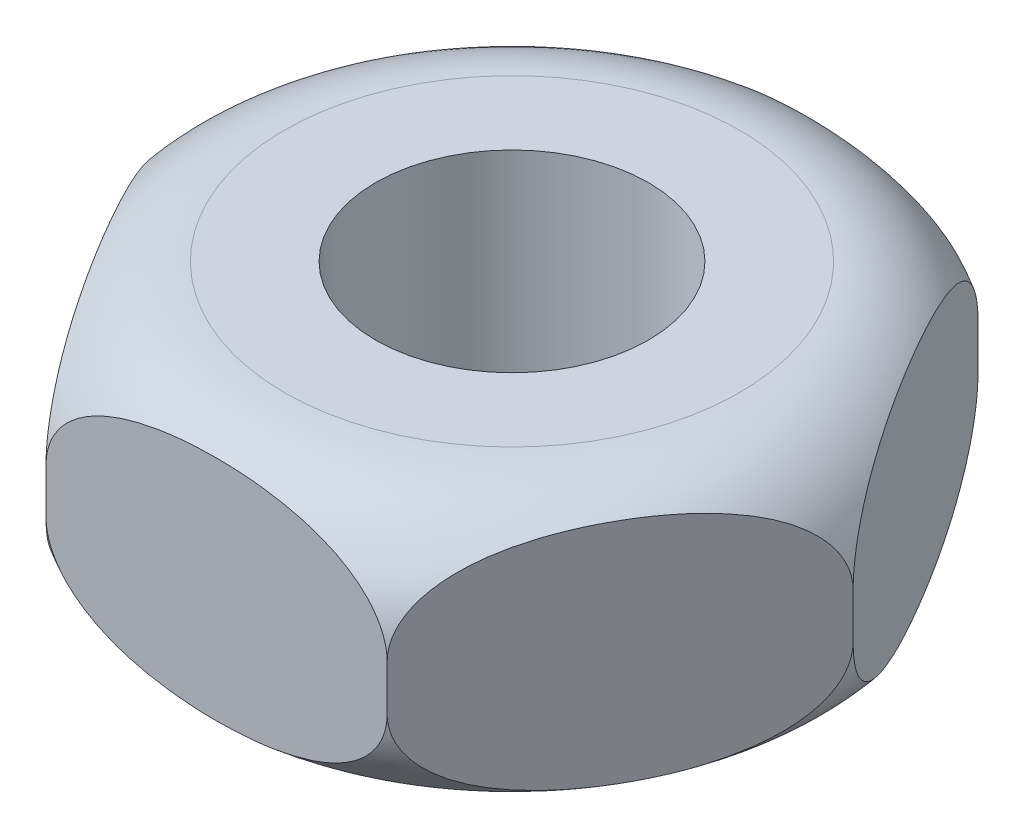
ISO-10303-21;
HEADER;
FILE_DESCRIPTION(('STEP AP214'),'2;1');
FILE_NAME('part.step','',(''),(''),'','','');
FILE_SCHEMA(('AUTOMOTIVE_DESIGN { 1 0 10303 214 1 1 1 1 }'));
ENDSEC;
DATA;
#1=APPLICATION_CONTEXT('core data for automotive mechanical design processes');
#2=APPLICATION_PROTOCOL_DEFINITION('international standard','automotive_design',2000,#1);
#3=PRODUCT_CONTEXT('',#1,'mechanical');
#4=PRODUCT('Part','Part','',(#3));
#5=PRODUCT_RELATED_PRODUCT_CATEGORY('part','',(#4));
#6=PRODUCT_DEFINITION_FORMATION('','',#4);
#7=PRODUCT_DEFINITION_CONTEXT('part definition',#1,'design');
#8=PRODUCT_DEFINITION('design','',#6,#7);
#9=PRODUCT_DEFINITION_SHAPE('','',#8);
#10=(LENGTH_UNIT() NAMED_UNIT(*) SI_UNIT(.MILLI.,.METRE.));
#11=(NAMED_UNIT(*) PLANE_ANGLE_UNIT() SI_UNIT($,.RADIAN.));
#12=(NAMED_UNIT(*) SI_UNIT($,.STERADIAN.) SOLID_ANGLE_UNIT());
#13=UNCERTAINTY_MEASURE_WITH_UNIT(LENGTH_MEASURE(1.E-05),#10,'distance_accuracy_value','');
#14=(GEOMETRIC_REPRESENTATION_CONTEXT(3) GLOBAL_UNCERTAINTY_ASSIGNED_CONTEXT((#13)) GLOBAL_UNIT_ASSIGNED_CONTEXT((#10,
#11,#12)) REPRESENTATION_CONTEXT('',''));
#15=CARTESIAN_POINT('',(0.,0.,0.));
#16=DIRECTION('',(0.,0.,1.));
#17=DIRECTION('',(1.,0.,0.));
#18=AXIS2_PLACEMENT_3D('',#15,#16,#17);
#19=CARTESIAN_POINT('',(7.49999999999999,12.,12.9903810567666));
#20=DIRECTION('',(-0.866025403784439,0.,-0.5));
#21=DIRECTION('',(-0.5,0.,0.866025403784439));
#22=AXIS2_PLACEMENT_3D('',#19,#20,#21);
#23=PLANE('',#22);
#24=CARTESIAN_POINT('',(14.999999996,5.0002,6.92820365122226E-09));
#25=CARTESIAN_POINT('',(15.0000133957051,4.92662677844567,-2.32020419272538E-05));
#26=CARTESIAN_POINT('',(14.9983823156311,4.85306414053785,0.00280191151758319));
#27=CARTESIAN_POINT('',(14.9919112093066,4.70654832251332,0.0140101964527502));
#28=CARTESIAN_POINT('',(14.98707309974,4.63359480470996,0.0223900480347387));
#29=CARTESIAN_POINT('',(14.9743126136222,4.48930336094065,0.0444918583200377));
#30=CARTESIAN_POINT('',(14.9664120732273,4.4179576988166,0.05817599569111));
#31=CARTESIAN_POINT('',(14.9476740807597,4.27683854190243,0.0906311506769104));
#32=CARTESIAN_POINT('',(14.9368363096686,4.20706521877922,0.109402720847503));
#33=CARTESIAN_POINT('',(14.9002253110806,4.00104214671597,0.1728148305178));
#34=CARTESIAN_POINT('',(14.8703145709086,3.86765582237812,0.224621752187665));
#35=CARTESIAN_POINT('',(14.8011296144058,3.61091812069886,0.344453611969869));
#36=CARTESIAN_POINT('',(14.7618383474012,3.48758557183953,0.412508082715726));
#37=CARTESIAN_POINT('',(14.6537720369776,3.19238988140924,0.599684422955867));
#38=CARTESIAN_POINT('',(14.5801475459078,3.02761718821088,0.727205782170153));
#39=CARTESIAN_POINT('',(14.4207526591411,2.72355495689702,1.00328582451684));
#40=CARTESIAN_POINT('',(14.3349549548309,2.58432437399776,1.15189180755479));
#41=CARTESIAN_POINT('',(14.174589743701,2.35698696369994,1.42965250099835));
#42=CARTESIAN_POINT('',(14.1015991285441,2.26433322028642,1.55607595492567));
#43=CARTESIAN_POINT('',(13.9518277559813,2.09209017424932,1.81548758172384));
#44=CARTESIAN_POINT('',(13.8750447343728,2.01250880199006,1.94847967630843));
#45=CARTESIAN_POINT('',(13.7186499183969,1.8650423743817,2.21936344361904));
#46=CARTESIAN_POINT('',(13.6390352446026,1.79716966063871,2.35726010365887));
#47=CARTESIAN_POINT('',(13.4777549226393,1.67192068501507,2.63660581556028));
#48=CARTESIAN_POINT('',(13.3960884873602,1.61454852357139,2.77805623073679));
#49=CARTESIAN_POINT('',(13.1577149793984,1.4620965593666,3.19093125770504));
#50=CARTESIAN_POINT('',(12.9990758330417,1.37905349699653,3.46570231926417));
#51=CARTESIAN_POINT('',(12.6788386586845,1.23993268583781,4.02036937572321));
#52=CARTESIAN_POINT('',(12.5172378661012,1.18388161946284,4.3002701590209));
#53=CARTESIAN_POINT('',(12.1917433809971,1.09405372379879,4.86404314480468));
#54=CARTESIAN_POINT('',(12.0278424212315,1.06038463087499,5.14792793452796));
#55=CARTESIAN_POINT('',(11.6994055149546,1.01286741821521,5.71679734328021));
#56=CARTESIAN_POINT('',(11.534869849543,0.999011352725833,6.00178147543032));
#57=CARTESIAN_POINT('',(11.2769149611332,0.991888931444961,6.44857244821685));
#58=CARTESIAN_POINT('',(11.183526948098,0.992307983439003,6.61032523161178));
#59=CARTESIAN_POINT('',(10.9968076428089,0.999175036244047,6.93373255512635));
#60=CARTESIAN_POINT('',(10.9034763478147,1.00562271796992,7.09538709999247));
#61=CARTESIAN_POINT('',(10.7168985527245,1.02472855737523,7.41854932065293));
#62=CARTESIAN_POINT('',(10.6236521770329,1.03739159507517,7.58005678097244));
#63=CARTESIAN_POINT('',(10.4374471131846,1.06928243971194,7.90257341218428));
#64=CARTESIAN_POINT('',(10.3444883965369,1.08850957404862,8.06358263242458));
#65=CARTESIAN_POINT('',(10.159599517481,1.13390851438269,8.38381956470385));
#66=CARTESIAN_POINT('',(10.0676665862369,1.16003481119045,8.5430520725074));
#67=CARTESIAN_POINT('',(9.88443808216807,1.21997599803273,8.86041315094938));
#68=CARTESIAN_POINT('',(9.79314241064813,1.25378966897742,9.01854189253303));
#69=CARTESIAN_POINT('',(9.61155259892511,1.32993555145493,9.33306467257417));
#70=CARTESIAN_POINT('',(9.52125737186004,1.37225731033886,9.48946059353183));
#71=CARTESIAN_POINT('',(9.3419413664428,1.46649223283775,9.8000450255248));
#72=CARTESIAN_POINT('',(9.2529201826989,1.51840226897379,9.95423423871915));
#73=CARTESIAN_POINT('',(9.10617777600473,1.6138564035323,10.2083995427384));
#74=CARTESIAN_POINT('',(9.04796453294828,1.65437463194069,10.3092278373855));
#75=CARTESIAN_POINT('',(8.93251713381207,1.74062104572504,10.5091885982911));
#76=CARTESIAN_POINT('',(8.87528294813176,1.7863490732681,10.6083211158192));
#77=CARTESIAN_POINT('',(8.70526267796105,1.93212782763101,10.9028048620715));
#78=CARTESIAN_POINT('',(8.59424187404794,2.04072089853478,11.0950985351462));
#79=CARTESIAN_POINT('',(8.37870310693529,2.28555383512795,11.468422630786));
#80=CARTESIAN_POINT('',(8.27424998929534,2.42202560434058,11.6493407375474));
#81=CARTESIAN_POINT('',(8.07719598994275,2.72595832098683,11.9906482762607));
#82=CARTESIAN_POINT('',(7.98457207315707,2.89335743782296,12.1510776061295));
#83=CARTESIAN_POINT('',(7.84375098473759,3.20318724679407,12.3949868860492));
#84=CARTESIAN_POINT('',(7.79075273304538,3.33685701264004,12.4867825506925));
#85=CARTESIAN_POINT('',(7.6958109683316,3.61921564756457,12.651226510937));
#86=CARTESIAN_POINT('',(7.65385795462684,3.76789145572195,12.7238912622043));
#87=CARTESIAN_POINT('',(7.58847984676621,4.05708787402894,12.8371294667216));
#88=CARTESIAN_POINT('',(7.56332757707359,4.19604144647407,12.8806944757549));
#89=CARTESIAN_POINT('',(7.52505071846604,4.48033058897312,12.9469919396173));
#90=CARTESIAN_POINT('',(7.51189985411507,4.62565148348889,12.9697699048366));
#91=CARTESIAN_POINT('',(7.50346960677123,4.80990270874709,12.9843715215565));
#92=CARTESIAN_POINT('',(7.50216749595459,4.84793294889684,12.986626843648));
#93=CARTESIAN_POINT('',(7.50043305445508,4.92403742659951,12.9896309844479));
#94=CARTESIAN_POINT('',(7.49999991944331,4.96211159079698,12.9903811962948));
#95=CARTESIAN_POINT('',(7.500000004,5.0002,12.9903810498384));
#96=B_SPLINE_CURVE_WITH_KNOTS('',3,(#24,#25,#26,#27,#28,#29,#30,#31,#32,#33,#34,#35,#36,#37,#38,
#39,#40,#41,#42,#43,#44,#45,#46,#47,#48,#49,#50,#51,#52,#53,#54,#55,#56,#57,#58,#59,#60,#61,#62,
#63,#64,#65,#66,#67,#68,#69,#70,#71,#72,#73,#74,#75,#76,#77,#78,#79,#80,#81,#82,#83,#84,#85,#86,
#87,#88,#89,#90,#91,#92,#93,#94,#95),.UNSPECIFIED.,.F.,.F.,(4,2,2,2,2,2,2,2,2,2,2,2,2,2,2,2,2,2,
2,2,2,2,2,2,2,2,2,2,2,2,2,2,2,2,2,4),(0.,0.22062935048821,0.441126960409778,0.660080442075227,
0.879057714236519,1.31570578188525,1.75315365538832,2.4123472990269,3.07304383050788,
3.59103920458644,4.1093476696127,4.62819916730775,5.14725284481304,6.12948696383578,
7.11269006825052,8.10059222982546,9.08809809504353,9.6483462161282,10.2085646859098,
10.7692237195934,11.3298253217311,11.8868175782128,12.443721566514,12.9999455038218,
13.5559883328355,13.9256967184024,14.2953939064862,15.0353083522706,15.7816484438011,
16.5265122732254,17.036597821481,17.5462431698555,17.9877536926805,18.4282952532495,
18.5426279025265,18.656854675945),.UNSPECIFIED.);
#97=CARTESIAN_POINT('',(15.,5.,0.));
#98=VERTEX_POINT('',#97);
#99=CARTESIAN_POINT('',(7.49999999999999,5.,12.9903810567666));
#100=VERTEX_POINT('',#99);
#101=EDGE_CURVE('E51',#98,#100,#96,.T.);
#102=ORIENTED_EDGE('',*,*,#101,.F.);
#103=DIRECTION('',(0.,-1.,0.));
#104=VECTOR('',#103,1.);
#105=CARTESIAN_POINT('',(15.,12.,0.));
#106=LINE('',#105,#104);
#107=CARTESIAN_POINT('',(15.,7.,0.));
#108=VERTEX_POINT('',#107);
#109=EDGE_CURVE('E44',#108,#98,#106,.T.);
#110=ORIENTED_EDGE('',*,*,#109,.F.);
#111=CARTESIAN_POINT('',(7.500000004,6.9998,12.9903810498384));
#112=CARTESIAN_POINT('',(7.49998660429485,7.07337322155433,12.9904042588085));
#113=CARTESIAN_POINT('',(7.50161768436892,7.14693585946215,12.987579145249));
#114=CARTESIAN_POINT('',(7.5080887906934,7.29345167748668,12.9763708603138));
#115=CARTESIAN_POINT('',(7.51292690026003,7.36640519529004,12.9679910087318));
#116=CARTESIAN_POINT('',(7.52568738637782,7.51069663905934,12.9458891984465));
#117=CARTESIAN_POINT('',(7.53358792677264,7.5820423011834,12.9322050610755));
#118=CARTESIAN_POINT('',(7.55232591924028,7.72316145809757,12.8997499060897));
#119=CARTESIAN_POINT('',(7.56316369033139,7.79293478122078,12.8809783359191));
#120=CARTESIAN_POINT('',(7.59977468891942,7.99895785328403,12.8175662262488));
#121=CARTESIAN_POINT('',(7.6296854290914,8.13234417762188,12.7657593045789));
#122=CARTESIAN_POINT('',(7.69887038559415,8.38908187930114,12.6459274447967));
#123=CARTESIAN_POINT('',(7.73816165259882,8.51241442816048,12.5778729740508));
#124=CARTESIAN_POINT('',(7.8462279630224,8.80761011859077,12.3906966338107));
#125=CARTESIAN_POINT('',(7.91985245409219,8.97238281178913,12.2631752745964));
#126=CARTESIAN_POINT('',(8.07924734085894,9.27644504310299,11.9870952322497));
#127=CARTESIAN_POINT('',(8.16504504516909,9.41567562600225,11.8384892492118));
#128=CARTESIAN_POINT('',(8.32541025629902,9.64301303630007,11.5607285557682));
#129=CARTESIAN_POINT('',(8.39840087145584,9.73566677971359,11.4343051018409));
#130=CARTESIAN_POINT('',(8.54817224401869,9.90790982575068,11.1748934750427));
#131=CARTESIAN_POINT('',(8.62495526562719,9.98749119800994,11.0419013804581));
#132=CARTESIAN_POINT('',(8.78135008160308,10.1349576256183,10.7710176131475));
#133=CARTESIAN_POINT('',(8.86096475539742,10.2028303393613,10.6331209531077));
#134=CARTESIAN_POINT('',(9.02224507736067,10.3280793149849,10.3537752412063));
#135=CARTESIAN_POINT('',(9.10391151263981,10.3854514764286,10.2123248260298));
#136=CARTESIAN_POINT('',(9.34228502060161,10.5379034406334,9.79944979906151));
#137=CARTESIAN_POINT('',(9.50092416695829,10.6209465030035,9.52467873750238));
#138=CARTESIAN_POINT('',(9.82116134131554,10.7600673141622,8.97001168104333));
#139=CARTESIAN_POINT('',(9.98276213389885,10.8161183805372,8.69011089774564));
#140=CARTESIAN_POINT('',(10.308256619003,10.9059462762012,8.12633791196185));
#141=CARTESIAN_POINT('',(10.4721575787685,10.939615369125,7.84245312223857));
#142=CARTESIAN_POINT('',(10.8005944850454,10.9871325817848,7.27358371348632));
#143=CARTESIAN_POINT('',(10.965130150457,11.0009886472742,6.9885995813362));
#144=CARTESIAN_POINT('',(11.2230850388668,11.008111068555,6.54180860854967));
#145=CARTESIAN_POINT('',(11.3164730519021,11.007692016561,6.38005582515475));
#146=CARTESIAN_POINT('',(11.5031923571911,11.000824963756,6.05664850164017));
#147=CARTESIAN_POINT('',(11.5965236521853,10.9943772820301,5.89499395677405));
#148=CARTESIAN_POINT('',(11.7831014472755,10.9752714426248,5.57183173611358));
#149=CARTESIAN_POINT('',(11.8763478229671,10.9626084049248,5.41032427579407));
#150=CARTESIAN_POINT('',(12.0625528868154,10.9307175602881,5.08780764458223));
#151=CARTESIAN_POINT('',(12.1555116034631,10.9114904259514,4.92679842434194));
#152=CARTESIAN_POINT('',(12.340400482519,10.8660914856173,4.60656149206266));
#153=CARTESIAN_POINT('',(12.4323334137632,10.8399651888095,4.44732898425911));
#154=CARTESIAN_POINT('',(12.615561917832,10.7800240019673,4.12996790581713));
#155=CARTESIAN_POINT('',(12.7068575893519,10.7462103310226,3.97183916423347));
#156=CARTESIAN_POINT('',(12.8884474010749,10.6700644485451,3.65731638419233));
#157=CARTESIAN_POINT('',(12.97874262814,10.6277426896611,3.50092046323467));
#158=CARTESIAN_POINT('',(13.1580586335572,10.5335077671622,3.1903360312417));
#159=CARTESIAN_POINT('',(13.2470798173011,10.4815977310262,3.03614681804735));
#160=CARTESIAN_POINT('',(13.3938222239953,10.3861435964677,2.78198151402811));
#161=CARTESIAN_POINT('',(13.4520354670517,10.3456253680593,2.68115321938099));
#162=CARTESIAN_POINT('',(13.567482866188,10.2593789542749,2.48119245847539));
#163=CARTESIAN_POINT('',(13.6247170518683,10.2136509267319,2.38205994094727));
#164=CARTESIAN_POINT('',(13.794737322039,10.067872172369,2.087576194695));
#165=CARTESIAN_POINT('',(13.9057581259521,9.9592791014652,1.89528252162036));
#166=CARTESIAN_POINT('',(14.1212968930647,9.71444616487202,1.5219584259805));
#167=CARTESIAN_POINT('',(14.2257500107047,9.57797439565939,1.34104031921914));
#168=CARTESIAN_POINT('',(14.4228040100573,9.27404167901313,0.999732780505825));
#169=CARTESIAN_POINT('',(14.5154279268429,9.10664256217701,0.839303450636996));
#170=CARTESIAN_POINT('',(14.6562490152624,8.7968127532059,0.595394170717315));
#171=CARTESIAN_POINT('',(14.7092472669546,8.66314298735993,0.503598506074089));
#172=CARTESIAN_POINT('',(14.8041890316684,8.38078435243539,0.339154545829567));
#173=CARTESIAN_POINT('',(14.8461420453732,8.23210854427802,0.26648979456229));
#174=CARTESIAN_POINT('',(14.9115201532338,7.94291212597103,0.153251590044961));
#175=CARTESIAN_POINT('',(14.9366724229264,7.8039585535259,0.109686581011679));
#176=CARTESIAN_POINT('',(14.9749492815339,7.51966941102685,0.0433891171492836));
#177=CARTESIAN_POINT('',(14.9881001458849,7.37434851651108,0.0206111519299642));
#178=CARTESIAN_POINT('',(14.9965303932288,7.19009729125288,0.00600953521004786));
#179=CARTESIAN_POINT('',(14.9978325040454,7.15206705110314,0.00375421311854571));
#180=CARTESIAN_POINT('',(14.9995669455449,7.07596257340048,0.000750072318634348));
#181=CARTESIAN_POINT('',(15.0000000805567,7.03788840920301,-1.39528286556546E-07));
#182=CARTESIAN_POINT('',(14.999999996,6.9998,6.92820403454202E-09));
#183=B_SPLINE_CURVE_WITH_KNOTS('',3,(#111,#112,#113,#114,#115,#116,#117,#118,#119,#120,#121,
#122,#123,#124,#125,#126,#127,#128,#129,#130,#131,#132,#133,#134,#135,#136,#137,#138,#139,#140,
#141,#142,#143,#144,#145,#146,#147,#148,#149,#150,#151,#152,#153,#154,#155,#156,#157,#158,#159,
#160,#161,#162,#163,#164,#165,#166,#167,#168,#169,#170,#171,#172,#173,#174,#175,#176,#177,#178,
#179,#180,#181,#182),.UNSPECIFIED.,.F.,.F.,(4,2,2,2,2,2,2,2,2,2,2,2,2,2,2,2,2,2,2,2,2,2,2,2,2,2,
2,2,2,2,2,2,2,2,2,4),(0.,0.220629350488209,0.441126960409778,0.660080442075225,
0.879057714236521,1.31570578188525,1.75315365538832,2.41234729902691,3.07304383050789,
3.59103920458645,4.10934766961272,4.62819916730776,5.14725284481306,6.1294869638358,
7.11269006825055,8.1005922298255,9.08809809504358,9.64834621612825,10.2085646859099,
10.7692237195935,11.3298253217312,11.8868175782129,12.443721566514,12.9999455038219,
13.5559883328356,13.9256967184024,14.2953939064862,15.0353083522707,15.7816484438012,
16.5265122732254,17.036597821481,17.5462431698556,17.9877536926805,18.4282952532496,
18.5426279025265,18.656854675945),.UNSPECIFIED.);
#184=CARTESIAN_POINT('',(7.49999999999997,7.,12.9903810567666));
#185=VERTEX_POINT('',#184);
#186=EDGE_CURVE('E125',#185,#108,#183,.T.);
#187=ORIENTED_EDGE('',*,*,#186,.F.);
#188=DIRECTION('',(0.,-1.,0.));
#189=VECTOR('',#188,1.);
#190=CARTESIAN_POINT('',(7.49999999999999,12.,12.9903810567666));
#191=LINE('',#190,#189);
#192=EDGE_CURVE('E100',#185,#100,#191,.T.);
#193=ORIENTED_EDGE('',*,*,#192,.T.);
#194=EDGE_LOOP('',(#102,#110,#187,#193));
#195=FACE_BOUND('',#194,.T.);
#196=ADVANCED_FACE('F32',(#195),#23,.F.);
#197=CARTESIAN_POINT('',(15.,12.,0.));
#198=DIRECTION('',(-0.866025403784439,0.,0.5));
#199=DIRECTION('',(0.5,0.,0.866025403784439));
#200=AXIS2_PLACEMENT_3D('',#197,#198,#199);
#201=PLANE('',#200);
#202=CARTESIAN_POINT('',(7.500000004,5.0002,-12.9903810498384));
#203=CARTESIAN_POINT('',(7.49998660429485,4.92662677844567,-12.9904042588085));
#204=CARTESIAN_POINT('',(7.50161768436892,4.85306414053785,-12.987579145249));
#205=CARTESIAN_POINT('',(7.5080887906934,4.70654832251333,-12.9763708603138));
#206=CARTESIAN_POINT('',(7.51292690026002,4.63359480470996,-12.9679910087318));
#207=CARTESIAN_POINT('',(7.52568738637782,4.48930336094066,-12.9458891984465));
#208=CARTESIAN_POINT('',(7.53358792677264,4.4179576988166,-12.9322050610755));
#209=CARTESIAN_POINT('',(7.55232591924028,4.27683854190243,-12.8997499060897));
#210=CARTESIAN_POINT('',(7.56316369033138,4.20706521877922,-12.8809783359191));
#211=CARTESIAN_POINT('',(7.59977468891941,4.00104214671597,-12.8175662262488));
#212=CARTESIAN_POINT('',(7.62968542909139,3.86765582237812,-12.7657593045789));
#213=CARTESIAN_POINT('',(7.69887038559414,3.61091812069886,-12.6459274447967));
#214=CARTESIAN_POINT('',(7.73816165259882,3.48758557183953,-12.5778729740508));
#215=CARTESIAN_POINT('',(7.84622796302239,3.19238988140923,-12.3906966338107));
#216=CARTESIAN_POINT('',(7.91985245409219,3.02761718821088,-12.2631752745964));
#217=CARTESIAN_POINT('',(8.07924734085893,2.72355495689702,-11.9870952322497));
#218=CARTESIAN_POINT('',(8.16504504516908,2.58432437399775,-11.8384892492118));
#219=CARTESIAN_POINT('',(8.32541025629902,2.35698696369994,-11.5607285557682));
#220=CARTESIAN_POINT('',(8.39840087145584,2.26433322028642,-11.4343051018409));
#221=CARTESIAN_POINT('',(8.54817224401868,2.09209017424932,-11.1748934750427));
#222=CARTESIAN_POINT('',(8.62495526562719,2.01250880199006,-11.0419013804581));
#223=CARTESIAN_POINT('',(8.78135008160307,1.8650423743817,-10.7710176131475));
#224=CARTESIAN_POINT('',(8.86096475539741,1.79716966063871,-10.6331209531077));
#225=CARTESIAN_POINT('',(9.02224507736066,1.67192068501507,-10.3537752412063));
#226=CARTESIAN_POINT('',(9.1039115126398,1.61454852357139,-10.2123248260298));
#227=CARTESIAN_POINT('',(9.3422850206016,1.4620965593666,-9.79944979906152));
#228=CARTESIAN_POINT('',(9.50092416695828,1.37905349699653,-9.52467873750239));
#229=CARTESIAN_POINT('',(9.82116134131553,1.23993268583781,-8.97001168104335));
#230=CARTESIAN_POINT('',(9.98276213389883,1.18388161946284,-8.69011089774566));
#231=CARTESIAN_POINT('',(10.3082566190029,1.09405372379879,-8.12633791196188));
#232=CARTESIAN_POINT('',(10.4721575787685,1.06038463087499,-7.84245312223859));
#233=CARTESIAN_POINT('',(10.8005944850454,1.01286741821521,-7.27358371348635));
#234=CARTESIAN_POINT('',(10.965130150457,0.999011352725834,-6.98859958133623));
#235=CARTESIAN_POINT('',(11.2230850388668,0.991888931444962,-6.54180860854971));
#236=CARTESIAN_POINT('',(11.316473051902,0.992307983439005,-6.38005582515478));
#237=CARTESIAN_POINT('',(11.5031923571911,0.999175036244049,-6.05664850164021));
#238=CARTESIAN_POINT('',(11.5965236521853,1.00562271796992,-5.89499395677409));
#239=CARTESIAN_POINT('',(11.7831014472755,1.02472855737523,-5.57183173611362));
#240=CARTESIAN_POINT('',(11.8763478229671,1.03739159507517,-5.41032427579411));
#241=CARTESIAN_POINT('',(12.0625528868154,1.06928243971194,-5.08780764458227));
#242=CARTESIAN_POINT('',(12.1555116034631,1.08850957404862,-4.92679842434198));
#243=CARTESIAN_POINT('',(12.340400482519,1.1339085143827,-4.60656149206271));
#244=CARTESIAN_POINT('',(12.4323334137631,1.16003481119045,-4.44732898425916));
#245=CARTESIAN_POINT('',(12.6155619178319,1.21997599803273,-4.12996790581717));
#246=CARTESIAN_POINT('',(12.7068575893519,1.25378966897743,-3.97183916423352));
#247=CARTESIAN_POINT('',(12.8884474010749,1.32993555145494,-3.65731638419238));
#248=CARTESIAN_POINT('',(12.97874262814,1.37225731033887,-3.50092046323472));
#249=CARTESIAN_POINT('',(13.1580586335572,1.46649223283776,-3.19033603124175));
#250=CARTESIAN_POINT('',(13.2470798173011,1.5184022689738,-3.0361468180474));
#251=CARTESIAN_POINT('',(13.3938222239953,1.61385640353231,-2.78198151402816));
#252=CARTESIAN_POINT('',(13.4520354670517,1.6543746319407,-2.68115321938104));
#253=CARTESIAN_POINT('',(13.5674828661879,1.74062104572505,-2.48119245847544));
#254=CARTESIAN_POINT('',(13.6247170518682,1.78634907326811,-2.38205994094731));
#255=CARTESIAN_POINT('',(13.794737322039,1.93212782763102,-2.08757619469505));
#256=CARTESIAN_POINT('',(13.9057581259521,2.04072089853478,-1.8952825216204));
#257=CARTESIAN_POINT('',(14.1212968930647,2.28555383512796,-1.52195842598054));
#258=CARTESIAN_POINT('',(14.2257500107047,2.42202560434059,-1.34104031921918));
#259=CARTESIAN_POINT('',(14.4228040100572,2.72595832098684,-0.999732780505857));
#260=CARTESIAN_POINT('',(14.5154279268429,2.89335743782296,-0.839303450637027));
#261=CARTESIAN_POINT('',(14.6562490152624,3.20318724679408,-0.595394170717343));
#262=CARTESIAN_POINT('',(14.7092472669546,3.33685701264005,-0.503598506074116));
#263=CARTESIAN_POINT('',(14.8041890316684,3.61921564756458,-0.339154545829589));
#264=CARTESIAN_POINT('',(14.8461420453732,3.76789145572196,-0.266489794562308));
#265=CARTESIAN_POINT('',(14.9115201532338,4.05708787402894,-0.153251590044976));
#266=CARTESIAN_POINT('',(14.9366724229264,4.19604144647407,-0.109686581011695));
#267=CARTESIAN_POINT('',(14.9749492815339,4.48033058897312,-0.0433891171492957));
#268=CARTESIAN_POINT('',(14.9881001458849,4.62565148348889,-0.0206111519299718));
#269=CARTESIAN_POINT('',(14.9965303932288,4.8099027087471,-0.00600953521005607));
#270=CARTESIAN_POINT('',(14.9978325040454,4.84793294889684,-0.00375421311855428));
#271=CARTESIAN_POINT('',(14.9995669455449,4.92403742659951,-0.00075007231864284));
#272=CARTESIAN_POINT('',(15.0000000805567,4.96211159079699,1.39528278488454E-07));
#273=CARTESIAN_POINT('',(14.999999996,5.0002,-6.92821039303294E-09));
#274=B_SPLINE_CURVE_WITH_KNOTS('',3,(#202,#203,#204,#205,#206,#207,#208,#209,#210,#211,#212,
#213,#214,#215,#216,#217,#218,#219,#220,#221,#222,#223,#224,#225,#226,#227,#228,#229,#230,#231,
#232,#233,#234,#235,#236,#237,#238,#239,#240,#241,#242,#243,#244,#245,#246,#247,#248,#249,#250,
#251,#252,#253,#254,#255,#256,#257,#258,#259,#260,#261,#262,#263,#264,#265,#266,#267,#268,#269,
#270,#271,#272,#273),.UNSPECIFIED.,.F.,.F.,(4,2,2,2,2,2,2,2,2,2,2,2,2,2,2,2,2,2,2,2,2,2,2,2,2,2,
2,2,2,2,2,2,2,2,2,4),(0.,0.220629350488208,0.441126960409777,0.660080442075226,
0.879057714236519,1.31570578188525,1.75315365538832,2.4123472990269,3.07304383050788,
3.59103920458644,4.10934766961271,4.62819916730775,5.14725284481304,6.12948696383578,
7.11269006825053,8.10059222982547,9.08809809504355,9.64834621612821,10.2085646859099,
10.7692237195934,11.3298253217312,11.8868175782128,12.443721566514,12.9999455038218,
13.5559883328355,13.9256967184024,14.2953939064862,15.0353083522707,15.7816484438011,
16.5265122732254,17.036597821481,17.5462431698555,17.9877536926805,18.4282952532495,
18.5426279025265,18.656854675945),.UNSPECIFIED.);
#275=CARTESIAN_POINT('',(7.49999999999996,5.,-12.9903810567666));
#276=VERTEX_POINT('',#275);
#277=EDGE_CURVE('E86',#276,#98,#274,.T.);
#278=ORIENTED_EDGE('',*,*,#277,.F.);
#279=DIRECTION('',(0.,-1.,0.));
#280=VECTOR('',#279,1.);
#281=CARTESIAN_POINT('',(7.49999999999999,12.,-12.9903810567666));
#282=LINE('',#281,#280);
#283=CARTESIAN_POINT('',(7.49999999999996,7.,-12.9903810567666));
#284=VERTEX_POINT('',#283);
#285=EDGE_CURVE('E106',#284,#276,#282,.T.);
#286=ORIENTED_EDGE('',*,*,#285,.F.);
#287=CARTESIAN_POINT('',(14.999999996,6.9998,-6.92821040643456E-09));
#288=CARTESIAN_POINT('',(15.0000133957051,7.07337322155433,2.32020419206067E-05));
#289=CARTESIAN_POINT('',(14.9983823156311,7.14693585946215,-0.00280191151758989));
#290=CARTESIAN_POINT('',(14.9919112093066,7.29345167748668,-0.0140101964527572));
#291=CARTESIAN_POINT('',(14.98707309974,7.36640519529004,-0.0223900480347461));
#292=CARTESIAN_POINT('',(14.9743126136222,7.51069663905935,-0.0444918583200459));
#293=CARTESIAN_POINT('',(14.9664120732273,7.5820423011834,-0.0581759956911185));
#294=CARTESIAN_POINT('',(14.9476740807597,7.72316145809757,-0.0906311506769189));
#295=CARTESIAN_POINT('',(14.9368363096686,7.79293478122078,-0.109402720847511));
#296=CARTESIAN_POINT('',(14.9002253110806,7.99895785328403,-0.172814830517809));
#297=CARTESIAN_POINT('',(14.8703145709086,8.13234417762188,-0.224621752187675));
#298=CARTESIAN_POINT('',(14.8011296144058,8.38908187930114,-0.344453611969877));
#299=CARTESIAN_POINT('',(14.7618383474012,8.51241442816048,-0.412508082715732));
#300=CARTESIAN_POINT('',(14.6537720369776,8.80761011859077,-0.599684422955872));
#301=CARTESIAN_POINT('',(14.5801475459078,8.97238281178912,-0.727205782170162));
#302=CARTESIAN_POINT('',(14.4207526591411,9.27644504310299,-1.00328582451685));
#303=CARTESIAN_POINT('',(14.3349549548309,9.41567562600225,-1.1518918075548));
#304=CARTESIAN_POINT('',(14.174589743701,9.64301303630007,-1.42965250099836));
#305=CARTESIAN_POINT('',(14.1015991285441,9.73566677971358,-1.55607595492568));
#306=CARTESIAN_POINT('',(13.9518277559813,9.90790982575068,-1.81548758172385));
#307=CARTESIAN_POINT('',(13.8750447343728,9.98749119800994,-1.94847967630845));
#308=CARTESIAN_POINT('',(13.7186499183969,10.1349576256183,-2.21936344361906));
#309=CARTESIAN_POINT('',(13.6390352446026,10.2028303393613,-2.35726010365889));
#310=CARTESIAN_POINT('',(13.4777549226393,10.3280793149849,-2.6366058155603));
#311=CARTESIAN_POINT('',(13.3960884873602,10.3854514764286,-2.77805623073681));
#312=CARTESIAN_POINT('',(13.1577149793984,10.5379034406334,-3.19093125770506));
#313=CARTESIAN_POINT('',(12.9990758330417,10.6209465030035,-3.46570231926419));
#314=CARTESIAN_POINT('',(12.6788386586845,10.7600673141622,-4.02036937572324));
#315=CARTESIAN_POINT('',(12.5172378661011,10.8161183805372,-4.30027015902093));
#316=CARTESIAN_POINT('',(12.191743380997,10.9059462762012,-4.86404314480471));
#317=CARTESIAN_POINT('',(12.0278424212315,10.939615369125,-5.147927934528));
#318=CARTESIAN_POINT('',(11.6994055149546,10.9871325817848,-5.71679734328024));
#319=CARTESIAN_POINT('',(11.534869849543,11.0009886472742,-6.00178147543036));
#320=CARTESIAN_POINT('',(11.2769149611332,11.008111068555,-6.44857244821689));
#321=CARTESIAN_POINT('',(11.1835269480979,11.007692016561,-6.61032523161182));
#322=CARTESIAN_POINT('',(10.9968076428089,11.000824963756,-6.93373255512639));
#323=CARTESIAN_POINT('',(10.9034763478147,10.9943772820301,-7.09538709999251));
#324=CARTESIAN_POINT('',(10.7168985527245,10.9752714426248,-7.41854932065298));
#325=CARTESIAN_POINT('',(10.6236521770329,10.9626084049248,-7.58005678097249));
#326=CARTESIAN_POINT('',(10.4374471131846,10.9307175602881,-7.90257341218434));
#327=CARTESIAN_POINT('',(10.3444883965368,10.9114904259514,-8.06358263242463));
#328=CARTESIAN_POINT('',(10.1595995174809,10.8660914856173,-8.3838195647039));
#329=CARTESIAN_POINT('',(10.0676665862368,10.8399651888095,-8.54305207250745));
#330=CARTESIAN_POINT('',(9.88443808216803,10.7800240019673,-8.86041315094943));
#331=CARTESIAN_POINT('',(9.79314241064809,10.7462103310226,-9.01854189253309));
#332=CARTESIAN_POINT('',(9.61155259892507,10.6700644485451,-9.33306467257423));
#333=CARTESIAN_POINT('',(9.52125737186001,10.6277426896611,-9.48946059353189));
#334=CARTESIAN_POINT('',(9.34194136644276,10.5335077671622,-9.80004502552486));
#335=CARTESIAN_POINT('',(9.25292018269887,10.4815977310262,-9.95423423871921));
#336=CARTESIAN_POINT('',(9.1061777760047,10.3861435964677,-10.2083995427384));
#337=CARTESIAN_POINT('',(9.04796453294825,10.3456253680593,-10.3092278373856));
#338=CARTESIAN_POINT('',(8.93251713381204,10.2593789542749,-10.5091885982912));
#339=CARTESIAN_POINT('',(8.87528294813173,10.2136509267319,-10.6083211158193));
#340=CARTESIAN_POINT('',(8.70526267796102,10.067872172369,-10.9028048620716));
#341=CARTESIAN_POINT('',(8.59424187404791,9.9592791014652,-11.0950985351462));
#342=CARTESIAN_POINT('',(8.37870310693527,9.71444616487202,-11.4684226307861));
#343=CARTESIAN_POINT('',(8.27424998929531,9.57797439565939,-11.6493407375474));
#344=CARTESIAN_POINT('',(8.07719598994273,9.27404167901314,-11.9906482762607));
#345=CARTESIAN_POINT('',(7.98457207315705,9.10664256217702,-12.1510776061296));
#346=CARTESIAN_POINT('',(7.84375098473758,8.79681275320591,-12.3949868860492));
#347=CARTESIAN_POINT('',(7.79075273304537,8.66314298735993,-12.4867825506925));
#348=CARTESIAN_POINT('',(7.69581096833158,8.3807843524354,-12.651226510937));
#349=CARTESIAN_POINT('',(7.65385795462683,8.23210854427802,-12.7238912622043));
#350=CARTESIAN_POINT('',(7.5884798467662,7.94291212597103,-12.8371294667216));
#351=CARTESIAN_POINT('',(7.56332757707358,7.8039585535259,-12.8806944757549));
#352=CARTESIAN_POINT('',(7.52505071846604,7.51966941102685,-12.9469919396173));
#353=CARTESIAN_POINT('',(7.51189985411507,7.37434851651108,-12.9697699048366));
#354=CARTESIAN_POINT('',(7.50346960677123,7.19009729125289,-12.9843715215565));
#355=CARTESIAN_POINT('',(7.50216749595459,7.15206705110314,-12.986626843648));
#356=CARTESIAN_POINT('',(7.50043305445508,7.07596257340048,-12.9896309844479));
#357=CARTESIAN_POINT('',(7.49999991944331,7.03788840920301,-12.9903811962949));
#358=CARTESIAN_POINT('',(7.500000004,6.9998,-12.9903810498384));
#359=B_SPLINE_CURVE_WITH_KNOTS('',3,(#287,#288,#289,#290,#291,#292,#293,#294,#295,#296,#297,
#298,#299,#300,#301,#302,#303,#304,#305,#306,#307,#308,#309,#310,#311,#312,#313,#314,#315,#316,
#317,#318,#319,#320,#321,#322,#323,#324,#325,#326,#327,#328,#329,#330,#331,#332,#333,#334,#335,
#336,#337,#338,#339,#340,#341,#342,#343,#344,#345,#346,#347,#348,#349,#350,#351,#352,#353,#354,
#355,#356,#357,#358),.UNSPECIFIED.,.F.,.F.,(4,2,2,2,2,2,2,2,2,2,2,2,2,2,2,2,2,2,2,2,2,2,2,2,2,2,
2,2,2,2,2,2,2,2,2,4),(0.,0.220629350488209,0.441126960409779,0.660080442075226,
0.879057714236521,1.31570578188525,1.75315365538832,2.41234729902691,3.07304383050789,
3.59103920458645,4.10934766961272,4.62819916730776,5.14725284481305,6.1294869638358,
7.11269006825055,8.1005922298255,9.08809809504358,9.64834621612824,10.2085646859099,
10.7692237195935,11.3298253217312,11.8868175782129,12.443721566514,12.9999455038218,
13.5559883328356,13.9256967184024,14.2953939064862,15.0353083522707,15.7816484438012,
16.5265122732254,17.036597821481,17.5462431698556,17.9877536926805,18.4282952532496,
18.5426279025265,18.656854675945),.UNSPECIFIED.);
#360=EDGE_CURVE('E105',#108,#284,#359,.T.);
#361=ORIENTED_EDGE('',*,*,#360,.F.);
#362=ORIENTED_EDGE('',*,*,#109,.T.);
#363=EDGE_LOOP('',(#278,#286,#361,#362));
#364=FACE_BOUND('',#363,.T.);
#365=ADVANCED_FACE('F104',(#364),#201,.F.);
#366=CARTESIAN_POINT('',(7.49999999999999,12.,-12.9903810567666));
#367=DIRECTION('',(0.,0.,1.));
#368=DIRECTION('',(1.,0.,0.));
#369=AXIS2_PLACEMENT_3D('',#366,#367,#368);
#370=PLANE('',#369);
#371=CARTESIAN_POINT('',(0.,0.992803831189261,-12.9903810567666));
#372=CARTESIAN_POINT('',(0.338473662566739,0.992794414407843,-12.9903810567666));
#373=CARTESIAN_POINT('',(0.676979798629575,1.00259834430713,-12.9903810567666));
#374=CARTESIAN_POINT('',(1.35295263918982,1.04271174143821,-12.9903810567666));
#375=CARTESIAN_POINT('',(1.69041872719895,1.07303163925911,-12.9903810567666));
#376=CARTESIAN_POINT('',(2.36159015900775,1.1568364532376,-12.9903810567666));
#377=CARTESIAN_POINT('',(2.69530375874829,1.21025145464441,-12.9903810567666));
#378=CARTESIAN_POINT('',(3.19146074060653,1.31121959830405,-12.9903810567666));
#379=CARTESIAN_POINT('',(3.35605091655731,1.34833238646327,-12.9903810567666));
#380=CARTESIAN_POINT('',(3.68327824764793,1.43030319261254,-12.9903810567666));
#381=CARTESIAN_POINT('',(3.84591581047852,1.4751595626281,-12.9903810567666));
#382=CARTESIAN_POINT('',(4.13676664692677,1.56382494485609,-12.9903810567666));
#383=CARTESIAN_POINT('',(4.26544582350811,1.60609728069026,-12.9903810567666));
#384=CARTESIAN_POINT('',(4.52061089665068,1.69673904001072,-12.9903810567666));
#385=CARTESIAN_POINT('',(4.64709687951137,1.74510822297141,-12.9903810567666));
#386=CARTESIAN_POINT('',(5.02280288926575,1.90037927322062,-12.9903810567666));
#387=CARTESIAN_POINT('',(5.26807445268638,2.01738696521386,-12.9903810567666));
#388=CARTESIAN_POINT('',(5.6239702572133,2.21759260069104,-12.9903810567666));
#389=CARTESIAN_POINT('',(5.74128747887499,2.28896300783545,-12.9903810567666));
#390=CARTESIAN_POINT('',(5.97005418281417,2.44053651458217,-12.9903810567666));
#391=CARTESIAN_POINT('',(6.0815025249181,2.5207413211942,-12.9903810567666));
#392=CARTESIAN_POINT('',(6.40417845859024,2.77523931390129,-12.9903810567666));
#393=CARTESIAN_POINT('',(6.60476422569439,2.96396801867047,-12.9903810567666));
#394=CARTESIAN_POINT('',(6.88909059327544,3.29907858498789,-12.9903810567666));
#395=CARTESIAN_POINT('',(6.9877395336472,3.43287208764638,-12.9903810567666));
#396=CARTESIAN_POINT('',(7.16289768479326,3.71440249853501,-12.9903810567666));
#397=CARTESIAN_POINT('',(7.23941989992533,3.86213114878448,-12.9903810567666));
#398=CARTESIAN_POINT('',(7.36572765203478,4.17036138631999,-12.9903810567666));
#399=CARTESIAN_POINT('',(7.41526433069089,4.33096669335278,-12.9903810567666));
#400=CARTESIAN_POINT('',(7.48214510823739,4.65875990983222,-12.9903810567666));
#401=CARTESIAN_POINT('',(7.49951734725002,4.82594193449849,-12.9903810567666));
#402=CARTESIAN_POINT('',(7.50040483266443,5.13949309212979,-12.9903810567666));
#403=CARTESIAN_POINT('',(7.4878628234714,5.28586430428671,-12.9903810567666));
#404=CARTESIAN_POINT('',(7.43788117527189,5.57425571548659,-12.9903810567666));
#405=CARTESIAN_POINT('',(7.40043999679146,5.71627564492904,-12.9903810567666));
#406=CARTESIAN_POINT('',(7.30403912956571,5.99011298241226,-12.9903810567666));
#407=CARTESIAN_POINT('',(7.24543704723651,6.12205819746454,-12.9903810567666));
#408=CARTESIAN_POINT('',(7.10992977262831,6.37609989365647,-12.9903810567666));
#409=CARTESIAN_POINT('',(7.03301747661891,6.49819252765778,-12.9903810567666));
#410=CARTESIAN_POINT('',(6.8204902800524,6.79192078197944,-12.9903810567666));
#411=CARTESIAN_POINT('',(6.67509824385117,6.9564835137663,-12.9903810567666));
#412=CARTESIAN_POINT('',(6.35997464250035,7.26044080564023,-12.9903810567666));
#413=CARTESIAN_POINT('',(6.19018345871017,7.39977177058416,-12.9903810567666));
#414=CARTESIAN_POINT('',(5.87306403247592,7.62712184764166,-12.9903810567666));
#415=CARTESIAN_POINT('',(5.72893413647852,7.71970057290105,-12.9903810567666));
#416=CARTESIAN_POINT('',(5.4330926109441,7.8919527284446,-12.9903810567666));
#417=CARTESIAN_POINT('',(5.28137649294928,7.97161839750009,-12.9903810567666));
#418=CARTESIAN_POINT('',(4.97224504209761,8.11938945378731,-12.9903810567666));
#419=CARTESIAN_POINT('',(4.81482303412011,8.18748073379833,-12.9903810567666));
#420=CARTESIAN_POINT('',(4.49585113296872,8.31326114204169,-12.9903810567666));
#421=CARTESIAN_POINT('',(4.33429965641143,8.37094620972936,-12.9903810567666));
#422=CARTESIAN_POINT('',(3.86345336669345,8.52415257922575,-12.9903810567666));
#423=CARTESIAN_POINT('',(3.55028534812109,8.60781661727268,-12.9903810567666));
#424=CARTESIAN_POINT('',(2.91796140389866,8.74848446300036,-12.9903810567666));
#425=CARTESIAN_POINT('',(2.59879992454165,8.80546213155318,-12.9903810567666));
#426=CARTESIAN_POINT('',(1.95619170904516,8.89735756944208,-12.9903810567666));
#427=CARTESIAN_POINT('',(1.63273354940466,8.93219366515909,-12.9903810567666));
#428=CARTESIAN_POINT('',(0.984465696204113,8.98237322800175,-12.9903810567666));
#429=CARTESIAN_POINT('',(0.659656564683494,8.99772411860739,-12.9903810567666));
#430=CARTESIAN_POINT('',(0.150586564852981,9.00751722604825,-12.9903810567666));
#431=CARTESIAN_POINT('',(-0.0335801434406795,9.00813766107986,-12.9903810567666));
#432=CARTESIAN_POINT('',(-0.401838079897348,9.00353076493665,-12.9903810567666));
#433=CARTESIAN_POINT('',(-0.585929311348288,8.99830372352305,-12.9903810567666));
#434=CARTESIAN_POINT('',(-0.953968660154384,8.98186012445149,-12.9903810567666));
#435=CARTESIAN_POINT('',(-1.13791659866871,8.97063955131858,-12.9903810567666));
#436=CARTESIAN_POINT('',(-1.50530762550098,8.9419022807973,-12.9903810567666));
#437=CARTESIAN_POINT('',(-1.68875075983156,8.92438617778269,-12.9903810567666));
#438=CARTESIAN_POINT('',(-2.05448278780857,8.88263446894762,-12.9903810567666));
#439=CARTESIAN_POINT('',(-2.23677330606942,8.85841322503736,-12.9903810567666));
#440=CARTESIAN_POINT('',(-2.60020774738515,8.80260662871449,-12.9903810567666));
#441=CARTESIAN_POINT('',(-2.7813518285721,8.77102231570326,-12.9903810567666));
#442=CARTESIAN_POINT('',(-3.14182990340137,8.69972293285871,-12.9903810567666));
#443=CARTESIAN_POINT('',(-3.32116575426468,8.66001734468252,-12.9903810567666));
#444=CARTESIAN_POINT('',(-3.67762473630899,8.57146038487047,-12.9903810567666));
#445=CARTESIAN_POINT('',(-3.8547473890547,8.5226070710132,-12.9903810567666));
#446=CARTESIAN_POINT('',(-4.21779092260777,8.4109182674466,-12.9903810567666));
#447=CARTESIAN_POINT('',(-4.40349167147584,8.34735817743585,-12.9903810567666));
#448=CARTESIAN_POINT('',(-4.76970503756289,8.20685785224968,-12.9903810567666));
#449=CARTESIAN_POINT('',(-4.95022040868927,8.12992487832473,-12.9903810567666));
#450=CARTESIAN_POINT('',(-5.30320960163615,7.96117455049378,-12.9903810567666));
#451=CARTESIAN_POINT('',(-5.47571699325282,7.8694282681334,-12.9903810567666));
#452=CARTESIAN_POINT('',(-5.81042795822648,7.66892673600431,-12.9903810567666));
#453=CARTESIAN_POINT('',(-5.97264310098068,7.56019107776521,-12.9903810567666));
#454=CARTESIAN_POINT('',(-6.27609401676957,7.32887741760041,-12.9903810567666));
#455=CARTESIAN_POINT('',(-6.41793396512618,7.20710233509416,-12.9903810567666));
#456=CARTESIAN_POINT('',(-6.68366527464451,6.94493744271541,-12.9903810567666));
#457=CARTESIAN_POINT('',(-6.80754820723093,6.80453895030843,-12.9903810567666));
#458=CARTESIAN_POINT('',(-7.03213885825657,6.50348821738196,-12.9903810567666));
#459=CARTESIAN_POINT('',(-7.13257056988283,6.34262615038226,-12.9903810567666));
#460=CARTESIAN_POINT('',(-7.30060223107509,6.0045310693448,-12.9903810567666));
#461=CARTESIAN_POINT('',(-7.36825759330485,5.82732629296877,-12.9903810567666));
#462=CARTESIAN_POINT('',(-7.45853930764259,5.48321394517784,-12.9903810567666));
#463=CARTESIAN_POINT('',(-7.48541481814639,5.31743046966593,-12.9903810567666));
#464=CARTESIAN_POINT('',(-7.5055038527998,4.98385369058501,-12.9903810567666));
#465=CARTESIAN_POINT('',(-7.49873913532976,4.81606175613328,-12.9903810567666));
#466=CARTESIAN_POINT('',(-7.4557835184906,4.50990216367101,-12.9903810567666));
#467=CARTESIAN_POINT('',(-7.42411868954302,4.37086981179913,-12.9903810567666));
#468=CARTESIAN_POINT('',(-7.33915653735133,4.09964037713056,-12.9903810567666));
#469=CARTESIAN_POINT('',(-7.2858545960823,3.96744476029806,-12.9903810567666));
#470=CARTESIAN_POINT('',(-7.14184097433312,3.67406787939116,-12.9903810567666));
#471=CARTESIAN_POINT('',(-7.04470834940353,3.51604448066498,-12.9903810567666));
#472=CARTESIAN_POINT('',(-6.82605536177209,3.21794469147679,-12.9903810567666));
#473=CARTESIAN_POINT('',(-6.70449359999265,3.0778994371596,-12.9903810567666));
#474=CARTESIAN_POINT('',(-6.38638105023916,2.75893282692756,-12.9903810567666));
#475=CARTESIAN_POINT('',(-6.18022945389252,2.58964592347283,-12.9903810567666));
#476=CARTESIAN_POINT('',(-5.74435104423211,2.28495415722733,-12.9903810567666));
#477=CARTESIAN_POINT('',(-5.51457184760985,2.14962697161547,-12.9903810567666));
#478=CARTESIAN_POINT('',(-5.07484096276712,1.92562465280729,-12.9903810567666));
#479=CARTESIAN_POINT('',(-4.86683854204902,1.83303131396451,-12.9903810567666));
#480=CARTESIAN_POINT('',(-4.44353589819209,1.66610861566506,-12.9903810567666));
#481=CARTESIAN_POINT('',(-4.22823012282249,1.59179352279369,-12.9903810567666));
#482=CARTESIAN_POINT('',(-3.79262606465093,1.45882937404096,-12.9903810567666));
#483=CARTESIAN_POINT('',(-3.57232207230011,1.40019932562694,-12.9903810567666));
#484=CARTESIAN_POINT('',(-3.12863771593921,1.29655739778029,-12.9903810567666));
#485=CARTESIAN_POINT('',(-2.90525815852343,1.25154201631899,-12.9903810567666));
#486=CARTESIAN_POINT('',(-2.45983701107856,1.17395817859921,-12.9903810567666));
#487=CARTESIAN_POINT('',(-2.23782577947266,1.14121280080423,-12.9903810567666));
#488=CARTESIAN_POINT('',(-1.79254368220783,1.08596203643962,-12.9903810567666));
#489=CARTESIAN_POINT('',(-1.56927277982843,1.06345694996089,-12.9903810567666));
#490=CARTESIAN_POINT('',(-1.12184498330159,1.02778344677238,-12.9903810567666));
#491=CARTESIAN_POINT('',(-0.89768759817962,1.01462125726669,-12.9903810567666));
#492=CARTESIAN_POINT('',(-0.449024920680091,0.997134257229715,-12.9903810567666));
#493=CARTESIAN_POINT('',(-0.224519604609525,0.992810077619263,-12.9903810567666));
#494=CARTESIAN_POINT('',(0.,0.992803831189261,-12.9903810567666));
#495=B_SPLINE_CURVE_WITH_KNOTS('',3,(#371,#372,#373,#374,#375,#376,#377,#378,#379,#380,#381,
#382,#383,#384,#385,#386,#387,#388,#389,#390,#391,#392,#393,#394,#395,#396,#397,#398,#399,#400,
#401,#402,#403,#404,#405,#406,#407,#408,#409,#410,#411,#412,#413,#414,#415,#416,#417,#418,#419,
#420,#421,#422,#423,#424,#425,#426,#427,#428,#429,#430,#431,#432,#433,#434,#435,#436,#437,#438,
#439,#440,#441,#442,#443,#444,#445,#446,#447,#448,#449,#450,#451,#452,#453,#454,#455,#456,#457,
#458,#459,#460,#461,#462,#463,#464,#465,#466,#467,#468,#469,#470,#471,#472,#473,#474,#475,#476,
#477,#478,#479,#480,#481,#482,#483,#484,#485,#486,#487,#488,#489,#490,#491,#492,#493,#494),
.UNSPECIFIED.,.T.,.F.,(4,2,2,2,2,2,2,2,2,2,2,2,2,2,2,2,2,2,2,2,2,2,2,2,2,2,2,2,2,2,2,2,2,2,2,2,
2,2,2,2,2,2,2,2,2,2,2,2,2,2,2,2,2,2,2,2,2,2,2,2,2,4),(0.,1.01531902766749,2.03115464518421,
3.04393636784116,3.54995396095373,4.05586399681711,4.46204359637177,4.86820717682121,
5.68114632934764,6.09273751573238,6.50440837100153,7.32428883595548,7.82132511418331,
8.31806867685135,8.81931879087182,9.32013016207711,9.75864439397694,10.1971857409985,
10.6286385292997,11.0602589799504,11.7153228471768,12.3720154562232,12.8852171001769,
13.3987260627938,13.9128564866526,14.4271870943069,15.3979934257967,16.3697486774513,
17.34506795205,18.3200155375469,18.8724410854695,19.4248392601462,19.9776079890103,
20.5303245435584,21.0818662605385,21.6333301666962,22.1841538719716,22.7350946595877,
23.3234776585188,23.9115421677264,24.496864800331,25.0815173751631,25.640862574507,
26.2004694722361,26.7663634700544,27.3312973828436,27.8319222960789,28.3322234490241,
28.7581168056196,29.1841011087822,29.7375070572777,30.2918588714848,31.0876574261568,
31.8852599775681,32.5673269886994,33.2499246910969,33.9333458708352,34.6165911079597,
35.289566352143,35.9625613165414,36.6360044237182,37.3094956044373),.UNSPECIFIED.);
#496=CARTESIAN_POINT('',(-7.50000000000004,5.,-12.9903810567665));
#497=VERTEX_POINT('',#496);
#498=EDGE_CURVE('E89',#497,#276,#495,.T.);
#499=ORIENTED_EDGE('',*,*,#498,.F.);
#500=DIRECTION('',(0.,-1.,0.));
#501=VECTOR('',#500,1.);
#502=CARTESIAN_POINT('',(-7.50000000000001,12.,-12.9903810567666));
#503=LINE('',#502,#501);
#504=CARTESIAN_POINT('',(-7.50000000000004,7.,-12.9903810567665));
#505=VERTEX_POINT('',#504);
#506=EDGE_CURVE('E107',#505,#497,#503,.T.);
#507=ORIENTED_EDGE('',*,*,#506,.F.);
#508=CARTESIAN_POINT('',(0.,11.0071961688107,-12.9903810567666));
#509=CARTESIAN_POINT('',(-0.338473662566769,11.0072055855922,-12.9903810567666));
#510=CARTESIAN_POINT('',(-0.676979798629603,10.9974016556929,-12.9903810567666));
#511=CARTESIAN_POINT('',(-1.35295263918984,10.9572882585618,-12.9903810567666));
#512=CARTESIAN_POINT('',(-1.69041872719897,10.9269683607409,-12.9903810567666));
#513=CARTESIAN_POINT('',(-2.36159015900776,10.8431635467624,-12.9903810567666));
#514=CARTESIAN_POINT('',(-2.69530375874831,10.7897485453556,-12.9903810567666));
#515=CARTESIAN_POINT('',(-3.19146074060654,10.6887804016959,-12.9903810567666));
#516=CARTESIAN_POINT('',(-3.35605091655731,10.6516676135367,-12.9903810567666));
#517=CARTESIAN_POINT('',(-3.68327824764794,10.5696968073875,-12.9903810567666));
#518=CARTESIAN_POINT('',(-3.84591581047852,10.5248404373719,-12.9903810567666));
#519=CARTESIAN_POINT('',(-4.13676664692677,10.4361750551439,-12.9903810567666));
#520=CARTESIAN_POINT('',(-4.26544582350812,10.3939027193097,-12.9903810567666));
#521=CARTESIAN_POINT('',(-4.52061089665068,10.3032609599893,-12.9903810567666));
#522=CARTESIAN_POINT('',(-4.64709687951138,10.2548917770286,-12.9903810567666));
#523=CARTESIAN_POINT('',(-5.02280288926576,10.0996207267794,-12.9903810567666));
#524=CARTESIAN_POINT('',(-5.26807445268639,9.98261303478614,-12.9903810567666));
#525=CARTESIAN_POINT('',(-5.62397025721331,9.78240739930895,-12.9903810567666));
#526=CARTESIAN_POINT('',(-5.741287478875,9.71103699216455,-12.9903810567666));
#527=CARTESIAN_POINT('',(-5.97005418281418,9.55946348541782,-12.9903810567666));
#528=CARTESIAN_POINT('',(-6.08150252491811,9.47925867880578,-12.9903810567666));
#529=CARTESIAN_POINT('',(-6.40417845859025,9.22476068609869,-12.9903810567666));
#530=CARTESIAN_POINT('',(-6.6047642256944,9.03603198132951,-12.9903810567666));
#531=CARTESIAN_POINT('',(-6.88909059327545,8.70092141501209,-12.9903810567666));
#532=CARTESIAN_POINT('',(-6.98773953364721,8.5671279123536,-12.9903810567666));
#533=CARTESIAN_POINT('',(-7.16289768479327,8.28559750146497,-12.9903810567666));
#534=CARTESIAN_POINT('',(-7.23941989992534,8.1378688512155,-12.9903810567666));
#535=CARTESIAN_POINT('',(-7.36572765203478,7.82963861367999,-12.9903810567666));
#536=CARTESIAN_POINT('',(-7.41526433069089,7.6690333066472,-12.9903810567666));
#537=CARTESIAN_POINT('',(-7.48214510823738,7.34124009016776,-12.9903810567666));
#538=CARTESIAN_POINT('',(-7.49951734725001,7.17405806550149,-12.9903810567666));
#539=CARTESIAN_POINT('',(-7.50040483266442,6.8605069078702,-12.9903810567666));
#540=CARTESIAN_POINT('',(-7.4878628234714,6.71413569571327,-12.9903810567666));
#541=CARTESIAN_POINT('',(-7.43788117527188,6.42574428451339,-12.9903810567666));
#542=CARTESIAN_POINT('',(-7.40043999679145,6.28372435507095,-12.9903810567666));
#543=CARTESIAN_POINT('',(-7.3040391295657,6.00988701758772,-12.9903810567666));
#544=CARTESIAN_POINT('',(-7.2454370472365,5.87794180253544,-12.9903810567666));
#545=CARTESIAN_POINT('',(-7.1099297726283,5.62390010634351,-12.9903810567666));
#546=CARTESIAN_POINT('',(-7.0330174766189,5.5018074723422,-12.9903810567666));
#547=CARTESIAN_POINT('',(-6.82049028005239,5.20807921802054,-12.9903810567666));
#548=CARTESIAN_POINT('',(-6.67509824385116,5.04351648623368,-12.9903810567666));
#549=CARTESIAN_POINT('',(-6.35997464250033,4.73955919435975,-12.9903810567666));
#550=CARTESIAN_POINT('',(-6.19018345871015,4.60022822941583,-12.9903810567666));
#551=CARTESIAN_POINT('',(-5.8730640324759,4.37287815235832,-12.9903810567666));
#552=CARTESIAN_POINT('',(-5.72893413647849,4.28029942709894,-12.9903810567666));
#553=CARTESIAN_POINT('',(-5.43309261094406,4.10804727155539,-12.9903810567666));
#554=CARTESIAN_POINT('',(-5.28137649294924,4.02838160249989,-12.9903810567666));
#555=CARTESIAN_POINT('',(-4.97224504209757,3.88061054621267,-12.9903810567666));
#556=CARTESIAN_POINT('',(-4.81482303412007,3.81251926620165,-12.9903810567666));
#557=CARTESIAN_POINT('',(-4.49585113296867,3.68673885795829,-12.9903810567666));
#558=CARTESIAN_POINT('',(-4.33429965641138,3.62905379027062,-12.9903810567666));
#559=CARTESIAN_POINT('',(-3.86345336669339,3.47584742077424,-12.9903810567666));
#560=CARTESIAN_POINT('',(-3.55028534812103,3.39218338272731,-12.9903810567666));
#561=CARTESIAN_POINT('',(-2.91796140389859,3.25151553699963,-12.9903810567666));
#562=CARTESIAN_POINT('',(-2.59879992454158,3.19453786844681,-12.9903810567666));
#563=CARTESIAN_POINT('',(-1.95619170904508,3.10264243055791,-12.9903810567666));
#564=CARTESIAN_POINT('',(-1.63273354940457,3.0678063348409,-12.9903810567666));
#565=CARTESIAN_POINT('',(-0.984465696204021,3.01762677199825,-12.9903810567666));
#566=CARTESIAN_POINT('',(-0.659656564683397,3.00227588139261,-12.9903810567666));
#567=CARTESIAN_POINT('',(-0.150586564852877,2.99248277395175,-12.9903810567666));
#568=CARTESIAN_POINT('',(0.033580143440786,2.99186233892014,-12.9903810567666));
#569=CARTESIAN_POINT('',(0.401838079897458,2.99646923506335,-12.9903810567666));
#570=CARTESIAN_POINT('',(0.585929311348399,3.00169627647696,-12.9903810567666));
#571=CARTESIAN_POINT('',(0.9539686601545,3.01813987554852,-12.9903810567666));
#572=CARTESIAN_POINT('',(1.13791659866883,3.02936044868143,-12.9903810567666));
#573=CARTESIAN_POINT('',(1.5053076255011,3.05809771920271,-12.9903810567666));
#574=CARTESIAN_POINT('',(1.68875075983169,3.07561382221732,-12.9903810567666));
#575=CARTESIAN_POINT('',(2.0544827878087,3.1173655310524,-12.9903810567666));
#576=CARTESIAN_POINT('',(2.23677330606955,3.14158677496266,-12.9903810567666));
#577=CARTESIAN_POINT('',(2.60020774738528,3.19739337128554,-12.9903810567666));
#578=CARTESIAN_POINT('',(2.78135182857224,3.22897768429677,-12.9903810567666));
#579=CARTESIAN_POINT('',(3.14182990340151,3.30027706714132,-12.9903810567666));
#580=CARTESIAN_POINT('',(3.32116575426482,3.33998265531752,-12.9903810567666));
#581=CARTESIAN_POINT('',(3.67762473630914,3.42853961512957,-12.9903810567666));
#582=CARTESIAN_POINT('',(3.85474738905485,3.47739292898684,-12.9903810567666));
#583=CARTESIAN_POINT('',(4.21779092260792,3.58908173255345,-12.9903810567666));
#584=CARTESIAN_POINT('',(4.40349167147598,3.6526418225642,-12.9903810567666));
#585=CARTESIAN_POINT('',(4.76970503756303,3.79314214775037,-12.9903810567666));
#586=CARTESIAN_POINT('',(4.9502204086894,3.87007512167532,-12.9903810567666));
#587=CARTESIAN_POINT('',(5.30320960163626,4.03882544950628,-12.9903810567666));
#588=CARTESIAN_POINT('',(5.47571699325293,4.13057173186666,-12.9903810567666));
#589=CARTESIAN_POINT('',(5.81042795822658,4.33107326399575,-12.9903810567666));
#590=CARTESIAN_POINT('',(5.97264310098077,4.43980892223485,-12.9903810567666));
#591=CARTESIAN_POINT('',(6.27609401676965,4.67112258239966,-12.9903810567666));
#592=CARTESIAN_POINT('',(6.41793396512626,4.79289766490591,-12.9903810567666));
#593=CARTESIAN_POINT('',(6.68366527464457,5.05506255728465,-12.9903810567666));
#594=CARTESIAN_POINT('',(6.80754820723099,5.19546104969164,-12.9903810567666));
#595=CARTESIAN_POINT('',(7.03213885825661,5.49651178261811,-12.9903810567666));
#596=CARTESIAN_POINT('',(7.13257056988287,5.65737384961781,-12.9903810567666));
#597=CARTESIAN_POINT('',(7.30060223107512,5.99546893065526,-12.9903810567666));
#598=CARTESIAN_POINT('',(7.36825759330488,6.17267370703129,-12.9903810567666));
#599=CARTESIAN_POINT('',(7.4585393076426,6.51678605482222,-12.9903810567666));
#600=CARTESIAN_POINT('',(7.4854148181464,6.68256953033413,-12.9903810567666));
#601=CARTESIAN_POINT('',(7.5055038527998,7.01614630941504,-12.9903810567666));
#602=CARTESIAN_POINT('',(7.49873913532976,7.18393824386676,-12.9903810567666));
#603=CARTESIAN_POINT('',(7.45578351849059,7.49009783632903,-12.9903810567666));
#604=CARTESIAN_POINT('',(7.42411868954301,7.62913018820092,-12.9903810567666));
#605=CARTESIAN_POINT('',(7.33915653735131,7.90035962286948,-12.9903810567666));
#606=CARTESIAN_POINT('',(7.28585459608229,8.03255523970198,-12.9903810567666));
#607=CARTESIAN_POINT('',(7.1418409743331,8.32593212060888,-12.9903810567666));
#608=CARTESIAN_POINT('',(7.04470834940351,8.48395551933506,-12.9903810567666));
#609=CARTESIAN_POINT('',(6.82605536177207,8.78205530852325,-12.9903810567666));
#610=CARTESIAN_POINT('',(6.70449359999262,8.92210056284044,-12.9903810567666));
#611=CARTESIAN_POINT('',(6.38638105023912,9.24106717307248,-12.9903810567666));
#612=CARTESIAN_POINT('',(6.18022945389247,9.41035407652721,-12.9903810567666));
#613=CARTESIAN_POINT('',(5.74435104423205,9.7150458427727,-12.9903810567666));
#614=CARTESIAN_POINT('',(5.51457184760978,9.85037302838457,-12.9903810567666));
#615=CARTESIAN_POINT('',(5.07484096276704,10.0743753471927,-12.9903810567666));
#616=CARTESIAN_POINT('',(4.86683854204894,10.1669686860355,-12.9903810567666));
#617=CARTESIAN_POINT('',(4.44353589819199,10.333891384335,-12.9903810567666));
#618=CARTESIAN_POINT('',(4.22823012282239,10.4082064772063,-12.9903810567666));
#619=CARTESIAN_POINT('',(3.79262606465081,10.5411706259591,-12.9903810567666));
#620=CARTESIAN_POINT('',(3.57232207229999,10.5998006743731,-12.9903810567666));
#621=CARTESIAN_POINT('',(3.12863771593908,10.7034426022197,-12.9903810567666));
#622=CARTESIAN_POINT('',(2.90525815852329,10.748457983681,-12.9903810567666));
#623=CARTESIAN_POINT('',(2.45983701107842,10.8260418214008,-12.9903810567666));
#624=CARTESIAN_POINT('',(2.23782577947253,10.8587871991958,-12.9903810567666));
#625=CARTESIAN_POINT('',(1.79254368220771,10.9140379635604,-12.9903810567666));
#626=CARTESIAN_POINT('',(1.56927277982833,10.9365430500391,-12.9903810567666));
#627=CARTESIAN_POINT('',(1.1218449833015,10.9722165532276,-12.9903810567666));
#628=CARTESIAN_POINT('',(0.897687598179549,10.9853787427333,-12.9903810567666));
#629=CARTESIAN_POINT('',(0.449024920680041,11.0028657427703,-12.9903810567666));
#630=CARTESIAN_POINT('',(0.224519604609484,11.0071899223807,-12.9903810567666));
#631=CARTESIAN_POINT('',(0.,11.0071961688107,-12.9903810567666));
#632=B_SPLINE_CURVE_WITH_KNOTS('',3,(#508,#509,#510,#511,#512,#513,#514,#515,#516,#517,#518,
#519,#520,#521,#522,#523,#524,#525,#526,#527,#528,#529,#530,#531,#532,#533,#534,#535,#536,#537,
#538,#539,#540,#541,#542,#543,#544,#545,#546,#547,#548,#549,#550,#551,#552,#553,#554,#555,#556,
#557,#558,#559,#560,#561,#562,#563,#564,#565,#566,#567,#568,#569,#570,#571,#572,#573,#574,#575,
#576,#577,#578,#579,#580,#581,#582,#583,#584,#585,#586,#587,#588,#589,#590,#591,#592,#593,#594,
#595,#596,#597,#598,#599,#600,#601,#602,#603,#604,#605,#606,#607,#608,#609,#610,#611,#612,#613,
#614,#615,#616,#617,#618,#619,#620,#621,#622,#623,#624,#625,#626,#627,#628,#629,#630,#631),
.UNSPECIFIED.,.T.,.F.,(4,2,2,2,2,2,2,2,2,2,2,2,2,2,2,2,2,2,2,2,2,2,2,2,2,2,2,2,2,2,2,2,2,2,2,2,
2,2,2,2,2,2,2,2,2,2,2,2,2,2,2,2,2,2,2,2,2,2,2,2,2,4),(0.,1.01531902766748,2.03115464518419,
3.04393636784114,3.5499539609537,4.05586399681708,4.46204359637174,4.86820717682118,
5.68114632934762,6.09273751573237,6.50440837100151,7.32428883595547,7.82132511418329,
8.31806867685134,8.81931879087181,9.32013016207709,9.75864439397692,10.1971857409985,
10.6286385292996,11.0602589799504,11.7153228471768,12.3720154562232,12.8852171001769,
13.3987260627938,13.9128564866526,14.4271870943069,15.3979934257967,16.3697486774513,
17.34506795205,18.320015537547,18.8724410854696,19.4248392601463,19.9776079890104,
20.5303245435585,21.0818662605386,21.6333301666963,22.1841538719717,22.7350946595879,
23.3234776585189,23.9115421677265,24.4968648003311,25.0815173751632,25.6408625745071,
26.2004694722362,26.7663634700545,27.3312973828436,27.8319222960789,28.3322234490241,
28.7581168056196,29.1841011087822,29.7375070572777,30.2918588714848,31.0876574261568,
31.8852599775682,32.5673269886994,33.249924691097,33.9333458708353,34.6165911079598,
35.2895663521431,35.9625613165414,36.6360044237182,37.3094956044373),.UNSPECIFIED.);
#633=EDGE_CURVE('E160',#284,#505,#632,.T.);
#634=ORIENTED_EDGE('',*,*,#633,.F.);
#635=ORIENTED_EDGE('',*,*,#285,.T.);
#636=EDGE_LOOP('',(#499,#507,#634,#635));
#637=FACE_BOUND('',#636,.T.);
#638=ADVANCED_FACE('F164',(#637),#370,.F.);
#639=CARTESIAN_POINT('',(-7.50000000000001,12.,-12.9903810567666));
#640=DIRECTION('',(0.866025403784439,0.,0.5));
#641=DIRECTION('',(0.5,0.,-0.866025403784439));
#642=AXIS2_PLACEMENT_3D('',#639,#640,#641);
#643=PLANE('',#642);
#644=CARTESIAN_POINT('',(-14.999999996,5.0002,-6.92824280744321E-09));
#645=CARTESIAN_POINT('',(-15.0000133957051,4.92662677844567,2.3202041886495E-05));
#646=CARTESIAN_POINT('',(-14.9983823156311,4.85306414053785,-0.00280191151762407));
#647=CARTESIAN_POINT('',(-14.9919112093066,4.70654832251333,-0.0140101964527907));
#648=CARTESIAN_POINT('',(-14.98707309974,4.63359480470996,-0.0223900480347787));
#649=CARTESIAN_POINT('',(-14.9743126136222,4.48930336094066,-0.0444918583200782));
#650=CARTESIAN_POINT('',(-14.9664120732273,4.4179576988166,-0.0581759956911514));
#651=CARTESIAN_POINT('',(-14.9476740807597,4.27683854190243,-0.0906311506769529));
#652=CARTESIAN_POINT('',(-14.9368363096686,4.20706521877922,-0.109402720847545));
#653=CARTESIAN_POINT('',(-14.9002253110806,4.00104214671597,-0.172814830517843));
#654=CARTESIAN_POINT('',(-14.8703145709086,3.86765582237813,-0.224621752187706));
#655=CARTESIAN_POINT('',(-14.8011296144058,3.61091812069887,-0.344453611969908));
#656=CARTESIAN_POINT('',(-14.7618383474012,3.48758557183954,-0.412508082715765));
#657=CARTESIAN_POINT('',(-14.6537720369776,3.19238988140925,-0.599684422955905));
#658=CARTESIAN_POINT('',(-14.5801475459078,3.02761718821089,-0.727205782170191));
#659=CARTESIAN_POINT('',(-14.4207526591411,2.72355495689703,-1.00328582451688));
#660=CARTESIAN_POINT('',(-14.3349549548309,2.58432437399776,-1.15189180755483));
#661=CARTESIAN_POINT('',(-14.174589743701,2.35698696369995,-1.42965250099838));
#662=CARTESIAN_POINT('',(-14.1015991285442,2.26433322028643,-1.5560759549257));
#663=CARTESIAN_POINT('',(-13.9518277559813,2.09209017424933,-1.81548758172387));
#664=CARTESIAN_POINT('',(-13.8750447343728,2.01250880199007,-1.94847967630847));
#665=CARTESIAN_POINT('',(-13.7186499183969,1.86504237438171,-2.21936344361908));
#666=CARTESIAN_POINT('',(-13.6390352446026,1.79716966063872,-2.35726010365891));
#667=CARTESIAN_POINT('',(-13.4777549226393,1.67192068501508,-2.63660581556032));
#668=CARTESIAN_POINT('',(-13.3960884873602,1.6145485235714,-2.77805623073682));
#669=CARTESIAN_POINT('',(-13.1577149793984,1.46209655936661,-3.19093125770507));
#670=CARTESIAN_POINT('',(-12.9990758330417,1.37905349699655,-3.4657023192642));
#671=CARTESIAN_POINT('',(-12.6788386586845,1.23993268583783,-4.02036937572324));
#672=CARTESIAN_POINT('',(-12.5172378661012,1.18388161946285,-4.30027015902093));
#673=CARTESIAN_POINT('',(-12.1917433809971,1.0940537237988,-4.86404314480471));
#674=CARTESIAN_POINT('',(-12.0278424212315,1.060384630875,-5.14792793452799));
#675=CARTESIAN_POINT('',(-11.6994055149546,1.01286741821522,-5.71679734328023));
#676=CARTESIAN_POINT('',(-11.534869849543,0.999011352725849,-6.00178147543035));
#677=CARTESIAN_POINT('',(-11.2769149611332,0.991888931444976,-6.44857244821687));
#678=CARTESIAN_POINT('',(-11.183526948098,0.992307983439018,-6.6103252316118));
#679=CARTESIAN_POINT('',(-10.9968076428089,0.999175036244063,-6.93373255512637));
#680=CARTESIAN_POINT('',(-10.9034763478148,1.00562271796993,-7.09538709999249));
#681=CARTESIAN_POINT('',(-10.7168985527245,1.02472855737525,-7.41854932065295));
#682=CARTESIAN_POINT('',(-10.6236521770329,1.03739159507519,-7.58005678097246));
#683=CARTESIAN_POINT('',(-10.4374471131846,1.06928243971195,-7.9025734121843));
#684=CARTESIAN_POINT('',(-10.3444883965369,1.08850957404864,-8.06358263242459));
#685=CARTESIAN_POINT('',(-10.159599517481,1.13390851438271,-8.38381956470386));
#686=CARTESIAN_POINT('',(-10.0676665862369,1.16003481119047,-8.54305207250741));
#687=CARTESIAN_POINT('',(-9.88443808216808,1.21997599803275,-8.86041315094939));
#688=CARTESIAN_POINT('',(-9.79314241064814,1.25378966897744,-9.01854189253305));
#689=CARTESIAN_POINT('',(-9.61155259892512,1.32993555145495,-9.33306467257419));
#690=CARTESIAN_POINT('',(-9.52125737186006,1.37225731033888,-9.48946059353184));
#691=CARTESIAN_POINT('',(-9.34194136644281,1.46649223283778,-9.80004502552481));
#692=CARTESIAN_POINT('',(-9.25292018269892,1.51840226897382,-9.95423423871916));
#693=CARTESIAN_POINT('',(-9.10617777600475,1.61385640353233,-10.2083995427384));
#694=CARTESIAN_POINT('',(-9.0479645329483,1.65437463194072,-10.3092278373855));
#695=CARTESIAN_POINT('',(-8.93251713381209,1.74062104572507,-10.5091885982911));
#696=CARTESIAN_POINT('',(-8.87528294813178,1.78634907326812,-10.6083211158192));
#697=CARTESIAN_POINT('',(-8.70526267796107,1.93212782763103,-10.9028048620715));
#698=CARTESIAN_POINT('',(-8.59424187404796,2.0407208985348,-11.0950985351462));
#699=CARTESIAN_POINT('',(-8.37870310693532,2.28555383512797,-11.468422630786));
#700=CARTESIAN_POINT('',(-8.27424998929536,2.4220256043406,-11.6493407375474));
#701=CARTESIAN_POINT('',(-8.07719598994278,2.72595832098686,-11.9906482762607));
#702=CARTESIAN_POINT('',(-7.9845720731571,2.89335743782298,-12.1510776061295));
#703=CARTESIAN_POINT('',(-7.84375098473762,3.20318724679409,-12.3949868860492));
#704=CARTESIAN_POINT('',(-7.79075273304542,3.33685701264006,-12.4867825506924));
#705=CARTESIAN_POINT('',(-7.69581096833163,3.61921564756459,-12.651226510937));
#706=CARTESIAN_POINT('',(-7.65385795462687,3.76789145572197,-12.7238912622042));
#707=CARTESIAN_POINT('',(-7.58847984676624,4.05708787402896,-12.8371294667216));
#708=CARTESIAN_POINT('',(-7.56332757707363,4.19604144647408,-12.8806944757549));
#709=CARTESIAN_POINT('',(-7.52505071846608,4.48033058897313,-12.9469919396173));
#710=CARTESIAN_POINT('',(-7.51189985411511,4.6256514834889,-12.9697699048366));
#711=CARTESIAN_POINT('',(-7.50346960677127,4.8099027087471,-12.9843715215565));
#712=CARTESIAN_POINT('',(-7.50216749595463,4.84793294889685,-12.986626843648));
#713=CARTESIAN_POINT('',(-7.50043305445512,4.92403742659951,-12.9896309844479));
#714=CARTESIAN_POINT('',(-7.49999991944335,4.96211159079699,-12.9903811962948));
#715=CARTESIAN_POINT('',(-7.50000000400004,5.0002,-12.9903810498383));
#716=B_SPLINE_CURVE_WITH_KNOTS('',3,(#644,#645,#646,#647,#648,#649,#650,#651,#652,#653,#654,
#655,#656,#657,#658,#659,#660,#661,#662,#663,#664,#665,#666,#667,#668,#669,#670,#671,#672,#673,
#674,#675,#676,#677,#678,#679,#680,#681,#682,#683,#684,#685,#686,#687,#688,#689,#690,#691,#692,
#693,#694,#695,#696,#697,#698,#699,#700,#701,#702,#703,#704,#705,#706,#707,#708,#709,#710,#711,
#712,#713,#714,#715),.UNSPECIFIED.,.F.,.F.,(4,2,2,2,2,2,2,2,2,2,2,2,2,2,2,2,2,2,2,2,2,2,2,2,2,2,
2,2,2,2,2,2,2,2,2,4),(0.,0.220629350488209,0.441126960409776,0.660080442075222,
0.879057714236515,1.31570578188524,1.75315365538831,2.41234729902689,3.07304383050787,
3.59103920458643,4.10934766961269,4.62819916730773,5.14725284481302,6.12948696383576,
7.1126900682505,8.10059222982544,9.08809809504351,9.64834621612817,10.2085646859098,
10.7692237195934,11.3298253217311,11.8868175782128,12.4437215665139,12.9999455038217,
13.5559883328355,13.9256967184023,14.2953939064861,15.0353083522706,15.7816484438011,
16.5265122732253,17.0365978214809,17.5462431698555,17.9877536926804,18.4282952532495,
18.5426279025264,18.6568546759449),.UNSPECIFIED.);
#717=CARTESIAN_POINT('',(-15.,5.,0.));
#718=VERTEX_POINT('',#717);
#719=EDGE_CURVE('E176',#718,#497,#716,.T.);
#720=ORIENTED_EDGE('',*,*,#719,.F.);
#721=DIRECTION('',(0.,-1.,0.));
#722=VECTOR('',#721,1.);
#723=CARTESIAN_POINT('',(-15.,12.,0.));
#724=LINE('',#723,#722);
#725=CARTESIAN_POINT('',(-15.,7.,0.));
#726=VERTEX_POINT('',#725);
#727=EDGE_CURVE('E112',#726,#718,#724,.T.);
#728=ORIENTED_EDGE('',*,*,#727,.F.);
#729=CARTESIAN_POINT('',(-7.50000000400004,6.9998,-12.9903810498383));
#730=CARTESIAN_POINT('',(-7.49998660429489,7.07337322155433,-12.9904042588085));
#731=CARTESIAN_POINT('',(-7.50161768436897,7.14693585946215,-12.987579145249));
#732=CARTESIAN_POINT('',(-7.50808879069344,7.29345167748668,-12.9763708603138));
#733=CARTESIAN_POINT('',(-7.51292690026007,7.36640519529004,-12.9679910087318));
#734=CARTESIAN_POINT('',(-7.52568738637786,7.51069663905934,-12.9458891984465));
#735=CARTESIAN_POINT('',(-7.53358792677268,7.5820423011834,-12.9322050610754));
#736=CARTESIAN_POINT('',(-7.55232591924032,7.72316145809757,-12.8997499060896));
#737=CARTESIAN_POINT('',(-7.56316369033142,7.79293478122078,-12.880978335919));
#738=CARTESIAN_POINT('',(-7.59977468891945,7.99895785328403,-12.8175662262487));
#739=CARTESIAN_POINT('',(-7.62968542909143,8.13234417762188,-12.7657593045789));
#740=CARTESIAN_POINT('',(-7.69887038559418,8.38908187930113,-12.6459274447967));
#741=CARTESIAN_POINT('',(-7.73816165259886,8.51241442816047,-12.5778729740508));
#742=CARTESIAN_POINT('',(-7.84622796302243,8.80761011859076,-12.3906966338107));
#743=CARTESIAN_POINT('',(-7.91985245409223,8.97238281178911,-12.2631752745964));
#744=CARTESIAN_POINT('',(-8.07924734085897,9.27644504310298,-11.9870952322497));
#745=CARTESIAN_POINT('',(-8.16504504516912,9.41567562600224,-11.8384892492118));
#746=CARTESIAN_POINT('',(-8.32541025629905,9.64301303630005,-11.5607285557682));
#747=CARTESIAN_POINT('',(-8.39840087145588,9.73566677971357,-11.4343051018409));
#748=CARTESIAN_POINT('',(-8.54817224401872,9.90790982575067,-11.1748934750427));
#749=CARTESIAN_POINT('',(-8.62495526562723,9.98749119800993,-11.0419013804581));
#750=CARTESIAN_POINT('',(-8.78135008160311,10.1349576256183,-10.7710176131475));
#751=CARTESIAN_POINT('',(-8.86096475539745,10.2028303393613,-10.6331209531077));
#752=CARTESIAN_POINT('',(-9.0222450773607,10.3280793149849,-10.3537752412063));
#753=CARTESIAN_POINT('',(-9.10391151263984,10.3854514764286,-10.2123248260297));
#754=CARTESIAN_POINT('',(-9.34228502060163,10.5379034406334,-9.7994497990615));
#755=CARTESIAN_POINT('',(-9.50092416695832,10.6209465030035,-9.52467873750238));
#756=CARTESIAN_POINT('',(-9.82116134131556,10.7600673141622,-8.97001168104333));
#757=CARTESIAN_POINT('',(-9.98276213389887,10.8161183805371,-8.69011089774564));
#758=CARTESIAN_POINT('',(-10.308256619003,10.9059462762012,-8.12633791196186));
#759=CARTESIAN_POINT('',(-10.4721575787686,10.939615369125,-7.84245312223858));
#760=CARTESIAN_POINT('',(-10.8005944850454,10.9871325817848,-7.27358371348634));
#761=CARTESIAN_POINT('',(-10.965130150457,11.0009886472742,-6.98859958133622));
#762=CARTESIAN_POINT('',(-11.2230850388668,11.008111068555,-6.5418086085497));
#763=CARTESIAN_POINT('',(-11.3164730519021,11.007692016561,-6.38005582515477));
#764=CARTESIAN_POINT('',(-11.5031923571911,11.0008249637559,-6.0566485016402));
#765=CARTESIAN_POINT('',(-11.5965236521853,10.9943772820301,-5.89499395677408));
#766=CARTESIAN_POINT('',(-11.7831014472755,10.9752714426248,-5.57183173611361));
#767=CARTESIAN_POINT('',(-11.8763478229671,10.9626084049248,-5.41032427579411));
#768=CARTESIAN_POINT('',(-12.0625528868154,10.930717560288,-5.08780764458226));
#769=CARTESIAN_POINT('',(-12.1555116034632,10.9114904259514,-4.92679842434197));
#770=CARTESIAN_POINT('',(-12.340400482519,10.8660914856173,-4.6065614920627));
#771=CARTESIAN_POINT('',(-12.4323334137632,10.8399651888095,-4.44732898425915));
#772=CARTESIAN_POINT('',(-12.615561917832,10.7800240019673,-4.12996790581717));
#773=CARTESIAN_POINT('',(-12.7068575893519,10.7462103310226,-3.97183916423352));
#774=CARTESIAN_POINT('',(-12.8884474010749,10.670064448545,-3.65731638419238));
#775=CARTESIAN_POINT('',(-12.97874262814,10.6277426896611,-3.50092046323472));
#776=CARTESIAN_POINT('',(-13.1580586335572,10.5335077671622,-3.19033603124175));
#777=CARTESIAN_POINT('',(-13.2470798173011,10.4815977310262,-3.0361468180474));
#778=CARTESIAN_POINT('',(-13.3938222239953,10.3861435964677,-2.78198151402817));
#779=CARTESIAN_POINT('',(-13.4520354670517,10.3456253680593,-2.68115321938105));
#780=CARTESIAN_POINT('',(-13.5674828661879,10.2593789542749,-2.48119245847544));
#781=CARTESIAN_POINT('',(-13.6247170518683,10.2136509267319,-2.38205994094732));
#782=CARTESIAN_POINT('',(-13.794737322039,10.067872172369,-2.08757619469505));
#783=CARTESIAN_POINT('',(-13.9057581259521,9.9592791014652,-1.89528252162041));
#784=CARTESIAN_POINT('',(-14.1212968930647,9.71444616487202,-1.52195842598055));
#785=CARTESIAN_POINT('',(-14.2257500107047,9.57797439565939,-1.34104031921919));
#786=CARTESIAN_POINT('',(-14.4228040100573,9.27404167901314,-0.999732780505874));
#787=CARTESIAN_POINT('',(-14.5154279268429,9.10664256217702,-0.839303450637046));
#788=CARTESIAN_POINT('',(-14.6562490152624,8.79681275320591,-0.595394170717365));
#789=CARTESIAN_POINT('',(-14.7092472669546,8.66314298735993,-0.503598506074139));
#790=CARTESIAN_POINT('',(-14.8041890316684,8.3807843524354,-0.339154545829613));
#791=CARTESIAN_POINT('',(-14.8461420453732,8.23210854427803,-0.266489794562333));
#792=CARTESIAN_POINT('',(-14.9115201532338,7.94291212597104,-0.153251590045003));
#793=CARTESIAN_POINT('',(-14.9366724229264,7.80395855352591,-0.109686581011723));
#794=CARTESIAN_POINT('',(-14.9749492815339,7.51966941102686,-0.0433891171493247));
#795=CARTESIAN_POINT('',(-14.9881001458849,7.37434851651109,-0.0206111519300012));
#796=CARTESIAN_POINT('',(-14.9965303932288,7.19009729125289,-0.00600953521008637));
#797=CARTESIAN_POINT('',(-14.9978325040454,7.15206705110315,-0.00375421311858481));
#798=CARTESIAN_POINT('',(-14.9995669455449,7.07596257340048,-0.0007500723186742));
#799=CARTESIAN_POINT('',(-15.0000000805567,7.03788840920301,1.39528246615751E-07));
#800=CARTESIAN_POINT('',(-14.999999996,6.9998,-6.92824298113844E-09));
#801=B_SPLINE_CURVE_WITH_KNOTS('',3,(#729,#730,#731,#732,#733,#734,#735,#736,#737,#738,#739,
#740,#741,#742,#743,#744,#745,#746,#747,#748,#749,#750,#751,#752,#753,#754,#755,#756,#757,#758,
#759,#760,#761,#762,#763,#764,#765,#766,#767,#768,#769,#770,#771,#772,#773,#774,#775,#776,#777,
#778,#779,#780,#781,#782,#783,#784,#785,#786,#787,#788,#789,#790,#791,#792,#793,#794,#795,#796,
#797,#798,#799,#800),.UNSPECIFIED.,.F.,.F.,(4,2,2,2,2,2,2,2,2,2,2,2,2,2,2,2,2,2,2,2,2,2,2,2,2,2,
2,2,2,2,2,2,2,2,2,4),(0.,0.220629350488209,0.441126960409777,0.660080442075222,
0.879057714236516,1.31570578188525,1.75315365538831,2.41234729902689,3.07304383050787,
3.59103920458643,4.1093476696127,4.62819916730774,5.14725284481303,6.12948696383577,
7.11269006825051,8.10059222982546,9.08809809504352,9.64834621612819,10.2085646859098,
10.7692237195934,11.3298253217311,11.8868175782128,12.4437215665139,12.9999455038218,
13.5559883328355,13.9256967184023,14.2953939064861,15.0353083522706,15.7816484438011,
16.5265122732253,17.0365978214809,17.5462431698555,17.9877536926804,18.4282952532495,
18.5426279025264,18.6568546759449),.UNSPECIFIED.);
#802=EDGE_CURVE('E155',#505,#726,#801,.T.);
#803=ORIENTED_EDGE('',*,*,#802,.F.);
#804=ORIENTED_EDGE('',*,*,#506,.T.);
#805=EDGE_LOOP('',(#720,#728,#803,#804));
#806=FACE_BOUND('',#805,.T.);
#807=ADVANCED_FACE('F167',(#806),#643,.F.);
#808=CARTESIAN_POINT('',(-15.,12.,0.));
#809=DIRECTION('',(0.866025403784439,0.,-0.5));
#810=DIRECTION('',(-0.5,0.,-0.866025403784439));
#811=AXIS2_PLACEMENT_3D('',#808,#809,#810);
#812=PLANE('',#811);
#813=CARTESIAN_POINT('',(-7.50000000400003,5.0002,12.9903810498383));
#814=CARTESIAN_POINT('',(-7.49998660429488,4.92662677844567,12.9904042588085));
#815=CARTESIAN_POINT('',(-7.50161768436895,4.85306414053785,12.987579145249));
#816=CARTESIAN_POINT('',(-7.50808879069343,4.70654832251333,12.9763708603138));
#817=CARTESIAN_POINT('',(-7.51292690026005,4.63359480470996,12.9679910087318));
#818=CARTESIAN_POINT('',(-7.52568738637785,4.48930336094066,12.9458891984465));
#819=CARTESIAN_POINT('',(-7.53358792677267,4.4179576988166,12.9322050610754));
#820=CARTESIAN_POINT('',(-7.55232591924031,4.27683854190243,12.8997499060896));
#821=CARTESIAN_POINT('',(-7.56316369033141,4.20706521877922,12.880978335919));
#822=CARTESIAN_POINT('',(-7.59977468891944,4.00104214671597,12.8175662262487));
#823=CARTESIAN_POINT('',(-7.62968542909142,3.86765582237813,12.7657593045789));
#824=CARTESIAN_POINT('',(-7.69887038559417,3.61091812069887,12.6459274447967));
#825=CARTESIAN_POINT('',(-7.73816165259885,3.48758557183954,12.5778729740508));
#826=CARTESIAN_POINT('',(-7.84622796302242,3.19238988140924,12.3906966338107));
#827=CARTESIAN_POINT('',(-7.91985245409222,3.02761718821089,12.2631752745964));
#828=CARTESIAN_POINT('',(-8.07924734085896,2.72355495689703,11.9870952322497));
#829=CARTESIAN_POINT('',(-8.16504504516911,2.58432437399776,11.8384892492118));
#830=CARTESIAN_POINT('',(-8.32541025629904,2.35698696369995,11.5607285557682));
#831=CARTESIAN_POINT('',(-8.39840087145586,2.26433322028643,11.4343051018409));
#832=CARTESIAN_POINT('',(-8.54817224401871,2.09209017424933,11.1748934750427));
#833=CARTESIAN_POINT('',(-8.62495526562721,2.01250880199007,11.0419013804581));
#834=CARTESIAN_POINT('',(-8.78135008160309,1.86504237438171,10.7710176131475));
#835=CARTESIAN_POINT('',(-8.86096475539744,1.79716966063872,10.6331209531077));
#836=CARTESIAN_POINT('',(-9.02224507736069,1.67192068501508,10.3537752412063));
#837=CARTESIAN_POINT('',(-9.10391151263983,1.6145485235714,10.2123248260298));
#838=CARTESIAN_POINT('',(-9.34228502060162,1.46209655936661,9.79944979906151));
#839=CARTESIAN_POINT('',(-9.5009241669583,1.37905349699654,9.52467873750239));
#840=CARTESIAN_POINT('',(-9.82116134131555,1.23993268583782,8.97001168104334));
#841=CARTESIAN_POINT('',(-9.98276213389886,1.18388161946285,8.69011089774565));
#842=CARTESIAN_POINT('',(-10.308256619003,1.0940537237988,8.12633791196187));
#843=CARTESIAN_POINT('',(-10.4721575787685,1.060384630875,7.84245312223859));
#844=CARTESIAN_POINT('',(-10.8005944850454,1.01286741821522,7.27358371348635));
#845=CARTESIAN_POINT('',(-10.965130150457,0.999011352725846,6.98859958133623));
#846=CARTESIAN_POINT('',(-11.2230850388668,0.991888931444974,6.54180860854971));
#847=CARTESIAN_POINT('',(-11.3164730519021,0.992307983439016,6.38005582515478));
#848=CARTESIAN_POINT('',(-11.5031923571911,0.999175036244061,6.05664850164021));
#849=CARTESIAN_POINT('',(-11.5965236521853,1.00562271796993,5.89499395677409));
#850=CARTESIAN_POINT('',(-11.7831014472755,1.02472855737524,5.57183173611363));
#851=CARTESIAN_POINT('',(-11.8763478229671,1.03739159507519,5.41032427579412));
#852=CARTESIAN_POINT('',(-12.0625528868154,1.06928243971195,5.08780764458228));
#853=CARTESIAN_POINT('',(-12.1555116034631,1.08850957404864,4.92679842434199));
#854=CARTESIAN_POINT('',(-12.340400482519,1.13390851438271,4.60656149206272));
#855=CARTESIAN_POINT('',(-12.4323334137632,1.16003481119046,4.44732898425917));
#856=CARTESIAN_POINT('',(-12.6155619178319,1.21997599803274,4.12996790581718));
#857=CARTESIAN_POINT('',(-12.7068575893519,1.25378966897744,3.97183916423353));
#858=CARTESIAN_POINT('',(-12.8884474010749,1.32993555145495,3.65731638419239));
#859=CARTESIAN_POINT('',(-12.97874262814,1.37225731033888,3.50092046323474));
#860=CARTESIAN_POINT('',(-13.1580586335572,1.46649223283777,3.19033603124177));
#861=CARTESIAN_POINT('',(-13.2470798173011,1.51840226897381,3.03614681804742));
#862=CARTESIAN_POINT('',(-13.3938222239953,1.61385640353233,2.78198151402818));
#863=CARTESIAN_POINT('',(-13.4520354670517,1.65437463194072,2.68115321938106));
#864=CARTESIAN_POINT('',(-13.5674828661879,1.74062104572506,2.48119245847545));
#865=CARTESIAN_POINT('',(-13.6247170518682,1.78634907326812,2.38205994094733));
#866=CARTESIAN_POINT('',(-13.794737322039,1.93212782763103,2.08757619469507));
#867=CARTESIAN_POINT('',(-13.9057581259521,2.0407208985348,1.89528252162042));
#868=CARTESIAN_POINT('',(-14.1212968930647,2.28555383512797,1.52195842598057));
#869=CARTESIAN_POINT('',(-14.2257500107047,2.4220256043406,1.3410403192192));
#870=CARTESIAN_POINT('',(-14.4228040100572,2.72595832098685,0.999732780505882));
#871=CARTESIAN_POINT('',(-14.5154279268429,2.89335743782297,0.839303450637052));
#872=CARTESIAN_POINT('',(-14.6562490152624,3.20318724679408,0.59539417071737));
#873=CARTESIAN_POINT('',(-14.7092472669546,3.33685701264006,0.503598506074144));
#874=CARTESIAN_POINT('',(-14.8041890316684,3.61921564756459,0.339154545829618));
#875=CARTESIAN_POINT('',(-14.8461420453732,3.76789145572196,0.266489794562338));
#876=CARTESIAN_POINT('',(-14.9115201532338,4.05708787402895,0.153251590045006));
#877=CARTESIAN_POINT('',(-14.9366724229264,4.19604144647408,0.109686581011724));
#878=CARTESIAN_POINT('',(-14.9749492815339,4.48033058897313,0.043389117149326));
#879=CARTESIAN_POINT('',(-14.9881001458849,4.6256514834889,0.0206111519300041));
#880=CARTESIAN_POINT('',(-14.9965303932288,4.8099027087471,0.00600953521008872));
#881=CARTESIAN_POINT('',(-14.9978325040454,4.84793294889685,0.0037542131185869));
#882=CARTESIAN_POINT('',(-14.9995669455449,4.92403742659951,0.000750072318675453));
#883=CARTESIAN_POINT('',(-15.0000000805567,4.96211159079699,-1.39528245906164E-07));
#884=CARTESIAN_POINT('',(-14.999999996,5.0002,6.92824297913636E-09));
#885=B_SPLINE_CURVE_WITH_KNOTS('',3,(#813,#814,#815,#816,#817,#818,#819,#820,#821,#822,#823,
#824,#825,#826,#827,#828,#829,#830,#831,#832,#833,#834,#835,#836,#837,#838,#839,#840,#841,#842,
#843,#844,#845,#846,#847,#848,#849,#850,#851,#852,#853,#854,#855,#856,#857,#858,#859,#860,#861,
#862,#863,#864,#865,#866,#867,#868,#869,#870,#871,#872,#873,#874,#875,#876,#877,#878,#879,#880,
#881,#882,#883,#884),.UNSPECIFIED.,.F.,.F.,(4,2,2,2,2,2,2,2,2,2,2,2,2,2,2,2,2,2,2,2,2,2,2,2,2,2,
2,2,2,2,2,2,2,2,2,4),(0.,0.220629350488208,0.441126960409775,0.660080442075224,
0.879057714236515,1.31570578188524,1.75315365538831,2.41234729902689,3.07304383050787,
3.59103920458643,4.10934766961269,4.62819916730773,5.14725284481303,6.12948696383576,
7.11269006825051,8.10059222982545,9.08809809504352,9.64834621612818,10.2085646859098,
10.7692237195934,11.3298253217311,11.8868175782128,12.4437215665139,12.9999455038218,
13.5559883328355,13.9256967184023,14.2953939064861,15.0353083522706,15.7816484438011,
16.5265122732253,17.0365978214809,17.5462431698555,17.9877536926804,18.4282952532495,
18.5426279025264,18.6568546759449),.UNSPECIFIED.);
#886=CARTESIAN_POINT('',(-7.49999999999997,5.,12.9903810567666));
#887=VERTEX_POINT('',#886);
#888=EDGE_CURVE('E200',#887,#718,#885,.T.);
#889=ORIENTED_EDGE('',*,*,#888,.F.);
#890=DIRECTION('',(0.,-1.,0.));
#891=VECTOR('',#890,1.);
#892=CARTESIAN_POINT('',(-7.50000000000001,12.,12.9903810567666));
#893=LINE('',#892,#891);
#894=CARTESIAN_POINT('',(-7.50000000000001,7.,12.9903810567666));
#895=VERTEX_POINT('',#894);
#896=EDGE_CURVE('E115',#895,#887,#893,.T.);
#897=ORIENTED_EDGE('',*,*,#896,.F.);
#898=CARTESIAN_POINT('',(-14.999999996,6.9998,6.92824299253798E-09));
#899=CARTESIAN_POINT('',(-15.0000133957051,7.07337322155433,-2.32020418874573E-05));
#900=CARTESIAN_POINT('',(-14.9983823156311,7.14693585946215,0.00280191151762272));
#901=CARTESIAN_POINT('',(-14.9919112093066,7.29345167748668,0.0140101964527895));
#902=CARTESIAN_POINT('',(-14.98707309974,7.36640519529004,0.0223900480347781));
#903=CARTESIAN_POINT('',(-14.9743126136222,7.51069663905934,0.0444918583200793));
#904=CARTESIAN_POINT('',(-14.9664120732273,7.5820423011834,0.0581759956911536));
#905=CARTESIAN_POINT('',(-14.9476740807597,7.72316145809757,0.0906311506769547));
#906=CARTESIAN_POINT('',(-14.9368363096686,7.79293478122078,0.109402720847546));
#907=CARTESIAN_POINT('',(-14.9002253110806,7.99895785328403,0.172814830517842));
#908=CARTESIAN_POINT('',(-14.8703145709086,8.13234417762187,0.224621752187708));
#909=CARTESIAN_POINT('',(-14.8011296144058,8.38908187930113,0.344453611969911));
#910=CARTESIAN_POINT('',(-14.7618383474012,8.51241442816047,0.412508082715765));
#911=CARTESIAN_POINT('',(-14.6537720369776,8.80761011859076,0.599684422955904));
#912=CARTESIAN_POINT('',(-14.5801475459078,8.97238281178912,0.727205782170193));
#913=CARTESIAN_POINT('',(-14.4207526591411,9.27644504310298,1.00328582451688));
#914=CARTESIAN_POINT('',(-14.3349549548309,9.41567562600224,1.15189180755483));
#915=CARTESIAN_POINT('',(-14.174589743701,9.64301303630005,1.42965250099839));
#916=CARTESIAN_POINT('',(-14.1015991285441,9.73566677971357,1.55607595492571));
#917=CARTESIAN_POINT('',(-13.9518277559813,9.90790982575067,1.81548758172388));
#918=CARTESIAN_POINT('',(-13.8750447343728,9.98749119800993,1.94847967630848));
#919=CARTESIAN_POINT('',(-13.7186499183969,10.1349576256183,2.21936344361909));
#920=CARTESIAN_POINT('',(-13.6390352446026,10.2028303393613,2.35726010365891));
#921=CARTESIAN_POINT('',(-13.4777549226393,10.3280793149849,2.63660581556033));
#922=CARTESIAN_POINT('',(-13.3960884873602,10.3854514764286,2.77805623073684));
#923=CARTESIAN_POINT('',(-13.1577149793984,10.5379034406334,3.19093125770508));
#924=CARTESIAN_POINT('',(-12.9990758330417,10.6209465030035,3.46570231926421));
#925=CARTESIAN_POINT('',(-12.6788386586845,10.7600673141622,4.02036937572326));
#926=CARTESIAN_POINT('',(-12.5172378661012,10.8161183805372,4.30027015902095));
#927=CARTESIAN_POINT('',(-12.191743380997,10.9059462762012,4.86404314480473));
#928=CARTESIAN_POINT('',(-12.0278424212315,10.939615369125,5.14792793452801));
#929=CARTESIAN_POINT('',(-11.6994055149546,10.9871325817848,5.71679734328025));
#930=CARTESIAN_POINT('',(-11.534869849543,11.0009886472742,6.00178147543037));
#931=CARTESIAN_POINT('',(-11.2769149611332,11.008111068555,6.4485724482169));
#932=CARTESIAN_POINT('',(-11.1835269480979,11.007692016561,6.61032523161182));
#933=CARTESIAN_POINT('',(-10.9968076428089,11.0008249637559,6.9337325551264));
#934=CARTESIAN_POINT('',(-10.9034763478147,10.9943772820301,7.09538709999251));
#935=CARTESIAN_POINT('',(-10.7168985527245,10.9752714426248,7.41854932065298));
#936=CARTESIAN_POINT('',(-10.6236521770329,10.9626084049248,7.58005678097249));
#937=CARTESIAN_POINT('',(-10.4374471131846,10.930717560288,7.90257341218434));
#938=CARTESIAN_POINT('',(-10.3444883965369,10.9114904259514,8.06358263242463));
#939=CARTESIAN_POINT('',(-10.159599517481,10.8660914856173,8.3838195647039));
#940=CARTESIAN_POINT('',(-10.0676665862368,10.8399651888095,8.54305207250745));
#941=CARTESIAN_POINT('',(-9.88443808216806,10.7800240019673,8.86041315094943));
#942=CARTESIAN_POINT('',(-9.79314241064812,10.7462103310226,9.01854189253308));
#943=CARTESIAN_POINT('',(-9.6115525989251,10.670064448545,9.33306467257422));
#944=CARTESIAN_POINT('',(-9.52125737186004,10.6277426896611,9.48946059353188));
#945=CARTESIAN_POINT('',(-9.34194136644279,10.5335077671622,9.80004502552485));
#946=CARTESIAN_POINT('',(-9.25292018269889,10.4815977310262,9.9542342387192));
#947=CARTESIAN_POINT('',(-9.10617777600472,10.3861435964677,10.2083995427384));
#948=CARTESIAN_POINT('',(-9.04796453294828,10.3456253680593,10.3092278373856));
#949=CARTESIAN_POINT('',(-8.93251713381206,10.2593789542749,10.5091885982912));
#950=CARTESIAN_POINT('',(-8.87528294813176,10.2136509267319,10.6083211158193));
#951=CARTESIAN_POINT('',(-8.70526267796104,10.067872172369,10.9028048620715));
#952=CARTESIAN_POINT('',(-8.59424187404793,9.95927910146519,11.0950985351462));
#953=CARTESIAN_POINT('',(-8.37870310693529,9.71444616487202,11.468422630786));
#954=CARTESIAN_POINT('',(-8.27424998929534,9.57797439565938,11.6493407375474));
#955=CARTESIAN_POINT('',(-8.07719598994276,9.27404167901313,11.9906482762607));
#956=CARTESIAN_POINT('',(-7.98457207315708,9.10664256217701,12.1510776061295));
#957=CARTESIAN_POINT('',(-7.84375098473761,8.7968127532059,12.3949868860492));
#958=CARTESIAN_POINT('',(-7.7907527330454,8.66314298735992,12.4867825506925));
#959=CARTESIAN_POINT('',(-7.69581096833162,8.38078435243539,12.651226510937));
#960=CARTESIAN_POINT('',(-7.65385795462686,8.23210854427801,12.7238912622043));
#961=CARTESIAN_POINT('',(-7.58847984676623,7.94291212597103,12.8371294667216));
#962=CARTESIAN_POINT('',(-7.56332757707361,7.8039585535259,12.8806944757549));
#963=CARTESIAN_POINT('',(-7.52505071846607,7.51966941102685,12.9469919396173));
#964=CARTESIAN_POINT('',(-7.5118998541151,7.37434851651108,12.9697699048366));
#965=CARTESIAN_POINT('',(-7.50346960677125,7.19009729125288,12.9843715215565));
#966=CARTESIAN_POINT('',(-7.50216749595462,7.15206705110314,12.986626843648));
#967=CARTESIAN_POINT('',(-7.50043305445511,7.07596257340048,12.9896309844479));
#968=CARTESIAN_POINT('',(-7.49999991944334,7.03788840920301,12.9903811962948));
#969=CARTESIAN_POINT('',(-7.50000000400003,6.9998,12.9903810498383));
#970=B_SPLINE_CURVE_WITH_KNOTS('',3,(#898,#899,#900,#901,#902,#903,#904,#905,#906,#907,#908,
#909,#910,#911,#912,#913,#914,#915,#916,#917,#918,#919,#920,#921,#922,#923,#924,#925,#926,#927,
#928,#929,#930,#931,#932,#933,#934,#935,#936,#937,#938,#939,#940,#941,#942,#943,#944,#945,#946,
#947,#948,#949,#950,#951,#952,#953,#954,#955,#956,#957,#958,#959,#960,#961,#962,#963,#964,#965,
#966,#967,#968,#969),.UNSPECIFIED.,.F.,.F.,(4,2,2,2,2,2,2,2,2,2,2,2,2,2,2,2,2,2,2,2,2,2,2,2,2,2,
2,2,2,2,2,2,2,2,2,4),(0.,0.22062935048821,0.441126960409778,0.660080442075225,0.879057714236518,
1.31570578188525,1.75315365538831,2.41234729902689,3.07304383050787,3.59103920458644,
4.1093476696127,4.62819916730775,5.14725284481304,6.12948696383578,7.11269006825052,
8.10059222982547,9.08809809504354,9.6483462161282,10.2085646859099,10.7692237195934,
11.3298253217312,11.8868175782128,12.443721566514,12.9999455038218,13.5559883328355,
13.9256967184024,14.2953939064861,15.0353083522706,15.7816484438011,16.5265122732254,
17.036597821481,17.5462431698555,17.9877536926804,18.4282952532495,18.5426279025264,
18.6568546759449),.UNSPECIFIED.);
#971=EDGE_CURVE('E58',#726,#895,#970,.T.);
#972=ORIENTED_EDGE('',*,*,#971,.F.);
#973=ORIENTED_EDGE('',*,*,#727,.T.);
#974=EDGE_LOOP('',(#889,#897,#972,#973));
#975=FACE_BOUND('',#974,.T.);
#976=ADVANCED_FACE('F198',(#975),#812,.F.);
#977=CARTESIAN_POINT('',(-7.50000000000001,12.,12.9903810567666));
#978=DIRECTION('',(0.,0.,-1.));
#979=DIRECTION('',(-1.,0.,0.));
#980=AXIS2_PLACEMENT_3D('',#977,#978,#979);
#981=PLANE('',#980);
#982=CARTESIAN_POINT('',(0.,0.992803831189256,12.9903810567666));
#983=CARTESIAN_POINT('',(-0.338473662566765,0.992794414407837,12.9903810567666));
#984=CARTESIAN_POINT('',(-0.676979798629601,1.00259834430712,12.9903810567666));
#985=CARTESIAN_POINT('',(-1.35295263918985,1.04271174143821,12.9903810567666));
#986=CARTESIAN_POINT('',(-1.69041872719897,1.07303163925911,12.9903810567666));
#987=CARTESIAN_POINT('',(-2.36159015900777,1.1568364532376,12.9903810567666));
#988=CARTESIAN_POINT('',(-2.69530375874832,1.21025145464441,12.9903810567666));
#989=CARTESIAN_POINT('',(-3.19146074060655,1.31121959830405,12.9903810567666));
#990=CARTESIAN_POINT('',(-3.35605091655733,1.34833238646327,12.9903810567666));
#991=CARTESIAN_POINT('',(-3.68327824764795,1.43030319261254,12.9903810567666));
#992=CARTESIAN_POINT('',(-3.84591581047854,1.4751595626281,12.9903810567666));
#993=CARTESIAN_POINT('',(-4.13676664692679,1.56382494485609,12.9903810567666));
#994=CARTESIAN_POINT('',(-4.26544582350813,1.60609728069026,12.9903810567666));
#995=CARTESIAN_POINT('',(-4.52061089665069,1.69673904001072,12.9903810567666));
#996=CARTESIAN_POINT('',(-4.64709687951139,1.74510822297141,12.9903810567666));
#997=CARTESIAN_POINT('',(-5.02280288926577,1.90037927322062,12.9903810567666));
#998=CARTESIAN_POINT('',(-5.2680744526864,2.01738696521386,12.9903810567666));
#999=CARTESIAN_POINT('',(-5.62397025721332,2.21759260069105,12.9903810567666));
#1000=CARTESIAN_POINT('',(-5.741287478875,2.28896300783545,12.9903810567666));
#1001=CARTESIAN_POINT('',(-5.97005418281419,2.44053651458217,12.9903810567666));
#1002=CARTESIAN_POINT('',(-6.08150252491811,2.5207413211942,12.9903810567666));
#1003=CARTESIAN_POINT('',(-6.40417845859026,2.77523931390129,12.9903810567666));
#1004=CARTESIAN_POINT('',(-6.6047642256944,2.96396801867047,12.9903810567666));
#1005=CARTESIAN_POINT('',(-6.88909059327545,3.29907858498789,12.9903810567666));
#1006=CARTESIAN_POINT('',(-6.98773953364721,3.43287208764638,12.9903810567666));
#1007=CARTESIAN_POINT('',(-7.16289768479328,3.71440249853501,12.9903810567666));
#1008=CARTESIAN_POINT('',(-7.23941989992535,3.86213114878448,12.9903810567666));
#1009=CARTESIAN_POINT('',(-7.36572765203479,4.17036138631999,12.9903810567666));
#1010=CARTESIAN_POINT('',(-7.41526433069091,4.33096669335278,12.9903810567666));
#1011=CARTESIAN_POINT('',(-7.4821451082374,4.65875990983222,12.9903810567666));
#1012=CARTESIAN_POINT('',(-7.49951734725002,4.82594193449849,12.9903810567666));
#1013=CARTESIAN_POINT('',(-7.50040483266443,5.13949309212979,12.9903810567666));
#1014=CARTESIAN_POINT('',(-7.48786282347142,5.28586430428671,12.9903810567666));
#1015=CARTESIAN_POINT('',(-7.43788117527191,5.57425571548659,12.9903810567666));
#1016=CARTESIAN_POINT('',(-7.40043999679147,5.71627564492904,12.9903810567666));
#1017=CARTESIAN_POINT('',(-7.30403912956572,5.99011298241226,12.9903810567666));
#1018=CARTESIAN_POINT('',(-7.24543704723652,6.12205819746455,12.9903810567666));
#1019=CARTESIAN_POINT('',(-7.10992977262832,6.37609989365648,12.9903810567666));
#1020=CARTESIAN_POINT('',(-7.03301747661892,6.49819252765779,12.9903810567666));
#1021=CARTESIAN_POINT('',(-6.82049028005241,6.79192078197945,12.9903810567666));
#1022=CARTESIAN_POINT('',(-6.67509824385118,6.95648351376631,12.9903810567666));
#1023=CARTESIAN_POINT('',(-6.35997464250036,7.26044080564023,12.9903810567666));
#1024=CARTESIAN_POINT('',(-6.19018345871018,7.39977177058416,12.9903810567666));
#1025=CARTESIAN_POINT('',(-5.87306403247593,7.62712184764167,12.9903810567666));
#1026=CARTESIAN_POINT('',(-5.72893413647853,7.71970057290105,12.9903810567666));
#1027=CARTESIAN_POINT('',(-5.4330926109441,7.8919527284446,12.9903810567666));
#1028=CARTESIAN_POINT('',(-5.28137649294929,7.9716183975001,12.9903810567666));
#1029=CARTESIAN_POINT('',(-4.97224504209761,8.11938945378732,12.9903810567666));
#1030=CARTESIAN_POINT('',(-4.81482303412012,8.18748073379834,12.9903810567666));
#1031=CARTESIAN_POINT('',(-4.49585113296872,8.3132611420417,12.9903810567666));
#1032=CARTESIAN_POINT('',(-4.33429965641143,8.37094620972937,12.9903810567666));
#1033=CARTESIAN_POINT('',(-3.86345336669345,8.52415257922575,12.9903810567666));
#1034=CARTESIAN_POINT('',(-3.55028534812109,8.60781661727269,12.9903810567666));
#1035=CARTESIAN_POINT('',(-2.91796140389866,8.74848446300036,12.9903810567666));
#1036=CARTESIAN_POINT('',(-2.59879992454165,8.80546213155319,12.9903810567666));
#1037=CARTESIAN_POINT('',(-1.95619170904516,8.89735756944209,12.9903810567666));
#1038=CARTESIAN_POINT('',(-1.63273354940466,8.9321936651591,12.9903810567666));
#1039=CARTESIAN_POINT('',(-0.98446569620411,8.98237322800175,12.9903810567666));
#1040=CARTESIAN_POINT('',(-0.659656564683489,8.9977241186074,12.9903810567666));
#1041=CARTESIAN_POINT('',(-0.150586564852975,9.00751722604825,12.9903810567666));
#1042=CARTESIAN_POINT('',(0.0335801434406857,9.00813766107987,12.9903810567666));
#1043=CARTESIAN_POINT('',(0.401838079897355,9.00353076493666,12.9903810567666));
#1044=CARTESIAN_POINT('',(0.585929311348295,8.99830372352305,12.9903810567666));
#1045=CARTESIAN_POINT('',(0.953968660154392,8.98186012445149,12.9903810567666));
#1046=CARTESIAN_POINT('',(1.13791659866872,8.97063955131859,12.9903810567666));
#1047=CARTESIAN_POINT('',(1.50530762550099,8.9419022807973,12.9903810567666));
#1048=CARTESIAN_POINT('',(1.68875075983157,8.9243861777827,12.9903810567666));
#1049=CARTESIAN_POINT('',(2.05448278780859,8.88263446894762,12.9903810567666));
#1050=CARTESIAN_POINT('',(2.23677330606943,8.85841322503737,12.9903810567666));
#1051=CARTESIAN_POINT('',(2.60020774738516,8.80260662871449,12.9903810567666));
#1052=CARTESIAN_POINT('',(2.78135182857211,8.77102231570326,12.9903810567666));
#1053=CARTESIAN_POINT('',(3.14182990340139,8.69972293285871,12.9903810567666));
#1054=CARTESIAN_POINT('',(3.32116575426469,8.66001734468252,12.9903810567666));
#1055=CARTESIAN_POINT('',(3.67762473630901,8.57146038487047,12.9903810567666));
#1056=CARTESIAN_POINT('',(3.85474738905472,8.52260707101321,12.9903810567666));
#1057=CARTESIAN_POINT('',(4.21779092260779,8.4109182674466,12.9903810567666));
#1058=CARTESIAN_POINT('',(4.40349167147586,8.34735817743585,12.9903810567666));
#1059=CARTESIAN_POINT('',(4.76970503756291,8.20685785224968,12.9903810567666));
#1060=CARTESIAN_POINT('',(4.95022040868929,8.12992487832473,12.9903810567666));
#1061=CARTESIAN_POINT('',(5.30320960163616,7.96117455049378,12.9903810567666));
#1062=CARTESIAN_POINT('',(5.47571699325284,7.8694282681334,12.9903810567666));
#1063=CARTESIAN_POINT('',(5.8104279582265,7.66892673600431,12.9903810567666));
#1064=CARTESIAN_POINT('',(5.9726431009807,7.56019107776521,12.9903810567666));
#1065=CARTESIAN_POINT('',(6.27609401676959,7.32887741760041,12.9903810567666));
#1066=CARTESIAN_POINT('',(6.4179339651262,7.20710233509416,12.9903810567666));
#1067=CARTESIAN_POINT('',(6.68366527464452,6.94493744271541,12.9903810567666));
#1068=CARTESIAN_POINT('',(6.80754820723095,6.80453895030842,12.9903810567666));
#1069=CARTESIAN_POINT('',(7.03213885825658,6.50348821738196,12.9903810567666));
#1070=CARTESIAN_POINT('',(7.13257056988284,6.34262615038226,12.9903810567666));
#1071=CARTESIAN_POINT('',(7.3006022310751,6.0045310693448,12.9903810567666));
#1072=CARTESIAN_POINT('',(7.36825759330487,5.82732629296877,12.9903810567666));
#1073=CARTESIAN_POINT('',(7.4585393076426,5.48321394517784,12.9903810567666));
#1074=CARTESIAN_POINT('',(7.4854148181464,5.31743046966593,12.9903810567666));
#1075=CARTESIAN_POINT('',(7.50550385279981,4.98385369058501,12.9903810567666));
#1076=CARTESIAN_POINT('',(7.49873913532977,4.81606175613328,12.9903810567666));
#1077=CARTESIAN_POINT('',(7.45578351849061,4.50990216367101,12.9903810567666));
#1078=CARTESIAN_POINT('',(7.42411868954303,4.37086981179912,12.9903810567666));
#1079=CARTESIAN_POINT('',(7.33915653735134,4.09964037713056,12.9903810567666));
#1080=CARTESIAN_POINT('',(7.28585459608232,3.96744476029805,12.9903810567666));
#1081=CARTESIAN_POINT('',(7.14184097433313,3.67406787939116,12.9903810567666));
#1082=CARTESIAN_POINT('',(7.04470834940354,3.51604448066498,12.9903810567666));
#1083=CARTESIAN_POINT('',(6.82605536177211,3.21794469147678,12.9903810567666));
#1084=CARTESIAN_POINT('',(6.70449359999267,3.0778994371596,12.9903810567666));
#1085=CARTESIAN_POINT('',(6.38638105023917,2.75893282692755,12.9903810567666));
#1086=CARTESIAN_POINT('',(6.18022945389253,2.58964592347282,12.9903810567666));
#1087=CARTESIAN_POINT('',(5.74435104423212,2.28495415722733,12.9903810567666));
#1088=CARTESIAN_POINT('',(5.51457184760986,2.14962697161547,12.9903810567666));
#1089=CARTESIAN_POINT('',(5.07484096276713,1.92562465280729,12.9903810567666));
#1090=CARTESIAN_POINT('',(4.86683854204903,1.8330313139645,12.9903810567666));
#1091=CARTESIAN_POINT('',(4.4435358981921,1.66610861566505,12.9903810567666));
#1092=CARTESIAN_POINT('',(4.2282301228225,1.59179352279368,12.9903810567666));
#1093=CARTESIAN_POINT('',(3.79262606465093,1.45882937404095,12.9903810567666));
#1094=CARTESIAN_POINT('',(3.57232207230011,1.40019932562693,12.9903810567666));
#1095=CARTESIAN_POINT('',(3.12863771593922,1.29655739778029,12.9903810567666));
#1096=CARTESIAN_POINT('',(2.90525815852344,1.25154201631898,12.9903810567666));
#1097=CARTESIAN_POINT('',(2.45983701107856,1.17395817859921,12.9903810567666));
#1098=CARTESIAN_POINT('',(2.23782577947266,1.14121280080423,12.9903810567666));
#1099=CARTESIAN_POINT('',(1.79254368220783,1.08596203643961,12.9903810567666));
#1100=CARTESIAN_POINT('',(1.56927277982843,1.06345694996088,12.9903810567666));
#1101=CARTESIAN_POINT('',(1.12184498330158,1.02778344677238,12.9903810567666));
#1102=CARTESIAN_POINT('',(0.897687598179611,1.01462125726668,12.9903810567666));
#1103=CARTESIAN_POINT('',(0.449024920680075,0.997134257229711,12.9903810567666));
#1104=CARTESIAN_POINT('',(0.224519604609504,0.992810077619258,12.9903810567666));
#1105=CARTESIAN_POINT('',(0.,0.992803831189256,12.9903810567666));
#1106=B_SPLINE_CURVE_WITH_KNOTS('',3,(#982,#983,#984,#985,#986,#987,#988,#989,#990,#991,#992,
#993,#994,#995,#996,#997,#998,#999,#1000,#1001,#1002,#1003,#1004,#1005,#1006,#1007,#1008,#1009,
#1010,#1011,#1012,#1013,#1014,#1015,#1016,#1017,#1018,#1019,#1020,#1021,#1022,#1023,#1024,#1025,
#1026,#1027,#1028,#1029,#1030,#1031,#1032,#1033,#1034,#1035,#1036,#1037,#1038,#1039,#1040,#1041,
#1042,#1043,#1044,#1045,#1046,#1047,#1048,#1049,#1050,#1051,#1052,#1053,#1054,#1055,#1056,#1057,
#1058,#1059,#1060,#1061,#1062,#1063,#1064,#1065,#1066,#1067,#1068,#1069,#1070,#1071,#1072,#1073,
#1074,#1075,#1076,#1077,#1078,#1079,#1080,#1081,#1082,#1083,#1084,#1085,#1086,#1087,#1088,#1089,
#1090,#1091,#1092,#1093,#1094,#1095,#1096,#1097,#1098,#1099,#1100,#1101,#1102,#1103,#1104,
#1105),.UNSPECIFIED.,.T.,.F.,(4,2,2,2,2,2,2,2,2,2,2,2,2,2,2,2,2,2,2,2,2,2,2,2,2,2,2,2,2,2,2,2,2,
2,2,2,2,2,2,2,2,2,2,2,2,2,2,2,2,2,2,2,2,2,2,2,2,2,2,2,2,4),(0.,1.01531902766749,
2.03115464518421,3.04393636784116,3.54995396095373,4.05586399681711,4.46204359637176,
4.8682071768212,5.68114632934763,6.09273751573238,6.50440837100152,7.32428883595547,
7.8213251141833,8.31806867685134,8.81931879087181,9.3201301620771,9.75864439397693,
10.1971857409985,10.6286385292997,11.0602589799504,11.7153228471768,12.3720154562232,
12.8852171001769,13.3987260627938,13.9128564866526,14.4271870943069,15.3979934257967,
16.3697486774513,17.34506795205,18.3200155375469,18.8724410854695,19.4248392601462,
19.9776079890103,20.5303245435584,21.0818662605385,21.6333301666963,22.1841538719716,
22.7350946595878,23.3234776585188,23.9115421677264,24.4968648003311,25.0815173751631,
25.6408625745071,26.2004694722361,26.7663634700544,27.3312973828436,27.8319222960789,
28.3322234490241,28.7581168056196,29.1841011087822,29.7375070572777,30.2918588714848,
31.0876574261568,31.8852599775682,32.5673269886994,33.249924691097,33.9333458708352,
34.6165911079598,35.2895663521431,35.9625613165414,36.6360044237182,37.3094956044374),.UNSPECIFIED.);
#1107=EDGE_CURVE('E201',#100,#887,#1106,.T.);
#1108=ORIENTED_EDGE('',*,*,#1107,.F.);
#1109=ORIENTED_EDGE('',*,*,#192,.F.);
#1110=CARTESIAN_POINT('',(0.,11.0071961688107,12.9903810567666));
#1111=CARTESIAN_POINT('',(0.338473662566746,11.0072055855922,12.9903810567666));
#1112=CARTESIAN_POINT('',(0.676979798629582,10.9974016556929,12.9903810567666));
#1113=CARTESIAN_POINT('',(1.35295263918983,10.9572882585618,12.9903810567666));
#1114=CARTESIAN_POINT('',(1.69041872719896,10.9269683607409,12.9903810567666));
#1115=CARTESIAN_POINT('',(2.36159015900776,10.8431635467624,12.9903810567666));
#1116=CARTESIAN_POINT('',(2.6953037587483,10.7897485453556,12.9903810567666));
#1117=CARTESIAN_POINT('',(3.19146074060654,10.688780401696,12.9903810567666));
#1118=CARTESIAN_POINT('',(3.35605091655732,10.6516676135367,12.9903810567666));
#1119=CARTESIAN_POINT('',(3.68327824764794,10.5696968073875,12.9903810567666));
#1120=CARTESIAN_POINT('',(3.84591581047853,10.5248404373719,12.9903810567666));
#1121=CARTESIAN_POINT('',(4.13676664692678,10.4361750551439,12.9903810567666));
#1122=CARTESIAN_POINT('',(4.26544582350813,10.3939027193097,12.9903810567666));
#1123=CARTESIAN_POINT('',(4.52061089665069,10.3032609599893,12.9903810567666));
#1124=CARTESIAN_POINT('',(4.64709687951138,10.2548917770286,12.9903810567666));
#1125=CARTESIAN_POINT('',(5.02280288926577,10.0996207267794,12.9903810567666));
#1126=CARTESIAN_POINT('',(5.26807445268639,9.98261303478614,12.9903810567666));
#1127=CARTESIAN_POINT('',(5.62397025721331,9.78240739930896,12.9903810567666));
#1128=CARTESIAN_POINT('',(5.741287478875,9.71103699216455,12.9903810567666));
#1129=CARTESIAN_POINT('',(5.97005418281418,9.55946348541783,12.9903810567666));
#1130=CARTESIAN_POINT('',(6.08150252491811,9.4792586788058,12.9903810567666));
#1131=CARTESIAN_POINT('',(6.40417845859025,9.22476068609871,12.9903810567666));
#1132=CARTESIAN_POINT('',(6.6047642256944,9.03603198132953,12.9903810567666));
#1133=CARTESIAN_POINT('',(6.88909059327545,8.70092141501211,12.9903810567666));
#1134=CARTESIAN_POINT('',(6.98773953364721,8.56712791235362,12.9903810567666));
#1135=CARTESIAN_POINT('',(7.16289768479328,8.28559750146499,12.9903810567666));
#1136=CARTESIAN_POINT('',(7.23941989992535,8.13786885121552,12.9903810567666));
#1137=CARTESIAN_POINT('',(7.36572765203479,7.82963861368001,12.9903810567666));
#1138=CARTESIAN_POINT('',(7.4152643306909,7.66903330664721,12.9903810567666));
#1139=CARTESIAN_POINT('',(7.4821451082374,7.34124009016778,12.9903810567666));
#1140=CARTESIAN_POINT('',(7.49951734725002,7.17405806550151,12.9903810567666));
#1141=CARTESIAN_POINT('',(7.50040483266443,6.86050690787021,12.9903810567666));
#1142=CARTESIAN_POINT('',(7.48786282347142,6.71413569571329,12.9903810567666));
#1143=CARTESIAN_POINT('',(7.43788117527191,6.42574428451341,12.9903810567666));
#1144=CARTESIAN_POINT('',(7.40043999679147,6.28372435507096,12.9903810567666));
#1145=CARTESIAN_POINT('',(7.30403912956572,6.00988701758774,12.9903810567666));
#1146=CARTESIAN_POINT('',(7.24543704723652,5.87794180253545,12.9903810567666));
#1147=CARTESIAN_POINT('',(7.10992977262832,5.62390010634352,12.9903810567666));
#1148=CARTESIAN_POINT('',(7.03301747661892,5.50180747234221,12.9903810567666));
#1149=CARTESIAN_POINT('',(6.82049028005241,5.20807921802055,12.9903810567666));
#1150=CARTESIAN_POINT('',(6.67509824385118,5.04351648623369,12.9903810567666));
#1151=CARTESIAN_POINT('',(6.35997464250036,4.73955919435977,12.9903810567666));
#1152=CARTESIAN_POINT('',(6.19018345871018,4.60022822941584,12.9903810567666));
#1153=CARTESIAN_POINT('',(5.87306403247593,4.37287815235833,12.9903810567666));
#1154=CARTESIAN_POINT('',(5.72893413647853,4.28029942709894,12.9903810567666));
#1155=CARTESIAN_POINT('',(5.4330926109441,4.1080472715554,12.9903810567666));
#1156=CARTESIAN_POINT('',(5.28137649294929,4.0283816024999,12.9903810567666));
#1157=CARTESIAN_POINT('',(4.97224504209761,3.88061054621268,12.9903810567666));
#1158=CARTESIAN_POINT('',(4.81482303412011,3.81251926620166,12.9903810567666));
#1159=CARTESIAN_POINT('',(4.49585113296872,3.6867388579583,12.9903810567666));
#1160=CARTESIAN_POINT('',(4.33429965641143,3.62905379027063,12.9903810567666));
#1161=CARTESIAN_POINT('',(3.86345336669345,3.47584742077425,12.9903810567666));
#1162=CARTESIAN_POINT('',(3.55028534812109,3.39218338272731,12.9903810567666));
#1163=CARTESIAN_POINT('',(2.91796140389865,3.25151553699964,12.9903810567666));
#1164=CARTESIAN_POINT('',(2.59879992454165,3.19453786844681,12.9903810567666));
#1165=CARTESIAN_POINT('',(1.95619170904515,3.10264243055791,12.9903810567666));
#1166=CARTESIAN_POINT('',(1.63273354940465,3.0678063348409,12.9903810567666));
#1167=CARTESIAN_POINT('',(0.9844656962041,3.01762677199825,12.9903810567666));
#1168=CARTESIAN_POINT('',(0.659656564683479,3.0022758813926,12.9903810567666));
#1169=CARTESIAN_POINT('',(0.150586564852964,2.99248277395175,12.9903810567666));
#1170=CARTESIAN_POINT('',(-0.0335801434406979,2.99186233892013,12.9903810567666));
#1171=CARTESIAN_POINT('',(-0.401838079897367,2.99646923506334,12.9903810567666));
#1172=CARTESIAN_POINT('',(-0.585929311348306,3.00169627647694,12.9903810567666));
#1173=CARTESIAN_POINT('',(-0.953968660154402,3.01813987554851,12.9903810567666));
#1174=CARTESIAN_POINT('',(-1.13791659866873,3.02936044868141,12.9903810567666));
#1175=CARTESIAN_POINT('',(-1.505307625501,3.0580977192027,12.9903810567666));
#1176=CARTESIAN_POINT('',(-1.68875075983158,3.0756138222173,12.9903810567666));
#1177=CARTESIAN_POINT('',(-2.0544827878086,3.11736553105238,12.9903810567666));
#1178=CARTESIAN_POINT('',(-2.23677330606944,3.14158677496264,12.9903810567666));
#1179=CARTESIAN_POINT('',(-2.60020774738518,3.19739337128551,12.9903810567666));
#1180=CARTESIAN_POINT('',(-2.78135182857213,3.22897768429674,12.9903810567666));
#1181=CARTESIAN_POINT('',(-3.1418299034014,3.30027706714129,12.9903810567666));
#1182=CARTESIAN_POINT('',(-3.32116575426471,3.33998265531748,12.9903810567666));
#1183=CARTESIAN_POINT('',(-3.67762473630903,3.42853961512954,12.9903810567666));
#1184=CARTESIAN_POINT('',(-3.85474738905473,3.4773929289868,12.9903810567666));
#1185=CARTESIAN_POINT('',(-4.21779092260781,3.5890817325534,12.9903810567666));
#1186=CARTESIAN_POINT('',(-4.40349167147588,3.65264182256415,12.9903810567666));
#1187=CARTESIAN_POINT('',(-4.76970503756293,3.79314214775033,12.9903810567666));
#1188=CARTESIAN_POINT('',(-4.9502204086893,3.87007512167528,12.9903810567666));
#1189=CARTESIAN_POINT('',(-5.30320960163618,4.03882544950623,12.9903810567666));
#1190=CARTESIAN_POINT('',(-5.47571699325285,4.13057173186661,12.9903810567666));
#1191=CARTESIAN_POINT('',(-5.81042795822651,4.3310732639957,12.9903810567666));
#1192=CARTESIAN_POINT('',(-5.97264310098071,4.4398089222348,12.9903810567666));
#1193=CARTESIAN_POINT('',(-6.2760940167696,4.6711225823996,12.9903810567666));
#1194=CARTESIAN_POINT('',(-6.41793396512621,4.79289766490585,12.9903810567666));
#1195=CARTESIAN_POINT('',(-6.68366527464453,5.05506255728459,12.9903810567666));
#1196=CARTESIAN_POINT('',(-6.80754820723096,5.19546104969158,12.9903810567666));
#1197=CARTESIAN_POINT('',(-7.03213885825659,5.49651178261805,12.9903810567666));
#1198=CARTESIAN_POINT('',(-7.13257056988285,5.65737384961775,12.9903810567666));
#1199=CARTESIAN_POINT('',(-7.30060223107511,5.9954689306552,12.9903810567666));
#1200=CARTESIAN_POINT('',(-7.36825759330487,6.17267370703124,12.9903810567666));
#1201=CARTESIAN_POINT('',(-7.45853930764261,6.51678605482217,12.9903810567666));
#1202=CARTESIAN_POINT('',(-7.48541481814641,6.68256953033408,12.9903810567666));
#1203=CARTESIAN_POINT('',(-7.50550385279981,7.016146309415,12.9903810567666));
#1204=CARTESIAN_POINT('',(-7.49873913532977,7.18393824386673,12.9903810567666));
#1205=CARTESIAN_POINT('',(-7.45578351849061,7.490097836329,12.9903810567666));
#1206=CARTESIAN_POINT('',(-7.42411868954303,7.62913018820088,12.9903810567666));
#1207=CARTESIAN_POINT('',(-7.33915653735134,7.90035962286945,12.9903810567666));
#1208=CARTESIAN_POINT('',(-7.28585459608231,8.03255523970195,12.9903810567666));
#1209=CARTESIAN_POINT('',(-7.14184097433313,8.32593212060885,12.9903810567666));
#1210=CARTESIAN_POINT('',(-7.04470834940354,8.48395551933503,12.9903810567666));
#1211=CARTESIAN_POINT('',(-6.8260553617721,8.78205530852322,12.9903810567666));
#1212=CARTESIAN_POINT('',(-6.70449359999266,8.92210056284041,12.9903810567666));
#1213=CARTESIAN_POINT('',(-6.38638105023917,9.24106717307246,12.9903810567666));
#1214=CARTESIAN_POINT('',(-6.18022945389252,9.41035407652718,12.9903810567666));
#1215=CARTESIAN_POINT('',(-5.74435104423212,9.71504584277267,12.9903810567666));
#1216=CARTESIAN_POINT('',(-5.51457184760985,9.85037302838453,12.9903810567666));
#1217=CARTESIAN_POINT('',(-5.07484096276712,10.0743753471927,12.9903810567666));
#1218=CARTESIAN_POINT('',(-4.86683854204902,10.1669686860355,12.9903810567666));
#1219=CARTESIAN_POINT('',(-4.44353589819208,10.333891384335,12.9903810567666));
#1220=CARTESIAN_POINT('',(-4.22823012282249,10.4082064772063,12.9903810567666));
#1221=CARTESIAN_POINT('',(-3.79262606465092,10.541170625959,12.9903810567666));
#1222=CARTESIAN_POINT('',(-3.5723220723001,10.5998006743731,12.9903810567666));
#1223=CARTESIAN_POINT('',(-3.12863771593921,10.7034426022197,12.9903810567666));
#1224=CARTESIAN_POINT('',(-2.90525815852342,10.748457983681,12.9903810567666));
#1225=CARTESIAN_POINT('',(-2.45983701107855,10.8260418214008,12.9903810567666));
#1226=CARTESIAN_POINT('',(-2.23782577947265,10.8587871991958,12.9903810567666));
#1227=CARTESIAN_POINT('',(-1.79254368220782,10.9140379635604,12.9903810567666));
#1228=CARTESIAN_POINT('',(-1.56927277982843,10.9365430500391,12.9903810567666));
#1229=CARTESIAN_POINT('',(-1.12184498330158,10.9722165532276,12.9903810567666));
#1230=CARTESIAN_POINT('',(-0.897687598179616,10.9853787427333,12.9903810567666));
#1231=CARTESIAN_POINT('',(-0.449024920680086,11.0028657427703,12.9903810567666));
#1232=CARTESIAN_POINT('',(-0.22451960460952,11.0071899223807,12.9903810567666));
#1233=CARTESIAN_POINT('',(0.,11.0071961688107,12.9903810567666));
#1234=B_SPLINE_CURVE_WITH_KNOTS('',3,(#1110,#1111,#1112,#1113,#1114,#1115,#1116,#1117,#1118,
#1119,#1120,#1121,#1122,#1123,#1124,#1125,#1126,#1127,#1128,#1129,#1130,#1131,#1132,#1133,#1134,
#1135,#1136,#1137,#1138,#1139,#1140,#1141,#1142,#1143,#1144,#1145,#1146,#1147,#1148,#1149,#1150,
#1151,#1152,#1153,#1154,#1155,#1156,#1157,#1158,#1159,#1160,#1161,#1162,#1163,#1164,#1165,#1166,
#1167,#1168,#1169,#1170,#1171,#1172,#1173,#1174,#1175,#1176,#1177,#1178,#1179,#1180,#1181,#1182,
#1183,#1184,#1185,#1186,#1187,#1188,#1189,#1190,#1191,#1192,#1193,#1194,#1195,#1196,#1197,#1198,
#1199,#1200,#1201,#1202,#1203,#1204,#1205,#1206,#1207,#1208,#1209,#1210,#1211,#1212,#1213,#1214,
#1215,#1216,#1217,#1218,#1219,#1220,#1221,#1222,#1223,#1224,#1225,#1226,#1227,#1228,#1229,#1230,
#1231,#1232,#1233),.UNSPECIFIED.,.T.,.F.,(4,2,2,2,2,2,2,2,2,2,2,2,2,2,2,2,2,2,2,2,2,2,2,2,2,2,2,
2,2,2,2,2,2,2,2,2,2,2,2,2,2,2,2,2,2,2,2,2,2,2,2,2,2,2,2,2,2,2,2,2,2,4),(0.,1.01531902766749,
2.03115464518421,3.04393636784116,3.54995396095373,4.05586399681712,4.46204359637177,
4.86820717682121,5.68114632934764,6.09273751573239,6.50440837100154,7.32428883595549,
7.82132511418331,8.31806867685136,8.81931879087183,9.32013016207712,9.75864439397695,
10.1971857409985,10.6286385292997,11.0602589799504,11.7153228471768,12.3720154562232,
12.8852171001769,13.3987260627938,13.9128564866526,14.4271870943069,15.3979934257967,
16.3697486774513,17.34506795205,18.320015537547,18.8724410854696,19.4248392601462,
19.9776079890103,20.5303245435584,21.0818662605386,21.6333301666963,22.1841538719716,
22.7350946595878,23.3234776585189,23.9115421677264,24.4968648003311,25.0815173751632,
25.6408625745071,26.2004694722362,26.7663634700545,27.3312973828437,27.8319222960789,
28.3322234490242,28.7581168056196,29.1841011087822,29.7375070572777,30.2918588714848,
31.0876574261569,31.8852599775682,32.5673269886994,33.249924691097,33.9333458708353,
34.6165911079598,35.2895663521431,35.9625613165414,36.6360044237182,37.3094956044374),.UNSPECIFIED.);
#1235=EDGE_CURVE('E11',#895,#185,#1234,.T.);
#1236=ORIENTED_EDGE('',*,*,#1235,.F.);
#1237=ORIENTED_EDGE('',*,*,#896,.T.);
#1238=EDGE_LOOP('',(#1108,#1109,#1236,#1237));
#1239=FACE_BOUND('',#1238,.T.);
#1240=ADVANCED_FACE('F212',(#1239),#981,.F.);
#1241=CARTESIAN_POINT('',(22.5,0.,-12.9903810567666));
#1242=DIRECTION('',(0.,1.,0.));
#1243=DIRECTION('',(0.,0.,1.));
#1244=AXIS2_PLACEMENT_3D('',#1241,#1242,#1243);
#1245=PLANE('',#1244);
#1246=CARTESIAN_POINT('',(0.,0.,0.));
#1247=DIRECTION('',(0.,1.,0.));
#1248=DIRECTION('',(0.,0.,1.));
#1249=AXIS2_PLACEMENT_3D('',#1246,#1247,#1248);
#1250=CIRCLE('',#1249,6.);
#1251=CARTESIAN_POINT('',(0.,0.,6.));
#1252=VERTEX_POINT('',#1251);
#1253=EDGE_CURVE('E122',#1252,#1252,#1250,.T.);
#1254=ORIENTED_EDGE('',*,*,#1253,.T.);
#1255=EDGE_LOOP('',(#1254));
#1256=FACE_BOUND('',#1255,.T.);
#1257=CARTESIAN_POINT('',(0.,0.,0.));
#1258=DIRECTION('',(0.,1.,0.));
#1259=DIRECTION('',(0.,0.,1.));
#1260=AXIS2_PLACEMENT_3D('',#1257,#1258,#1259);
#1261=CIRCLE('',#1260,9.99999999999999);
#1262=CARTESIAN_POINT('',(0.,0.,9.99999999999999));
#1263=VERTEX_POINT('',#1262);
#1264=EDGE_CURVE('E202',#1263,#1263,#1261,.T.);
#1265=ORIENTED_EDGE('',*,*,#1264,.F.);
#1266=EDGE_LOOP('',(#1265));
#1267=FACE_BOUND('',#1266,.T.);
#1268=ADVANCED_FACE('F217',(#1256,#1267),#1245,.F.);
#1269=CARTESIAN_POINT('',(22.5,12.,-12.9903810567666));
#1270=DIRECTION('',(0.,1.,0.));
#1271=DIRECTION('',(0.,0.,1.));
#1272=AXIS2_PLACEMENT_3D('',#1269,#1270,#1271);
#1273=PLANE('',#1272);
#1274=CARTESIAN_POINT('',(0.,12.,0.));
#1275=DIRECTION('',(0.,1.,0.));
#1276=DIRECTION('',(0.,0.,1.));
#1277=AXIS2_PLACEMENT_3D('',#1274,#1275,#1276);
#1278=CIRCLE('',#1277,6.);
#1279=CARTESIAN_POINT('',(0.,12.,6.));
#1280=VERTEX_POINT('',#1279);
#1281=EDGE_CURVE('E119',#1280,#1280,#1278,.T.);
#1282=ORIENTED_EDGE('',*,*,#1281,.F.);
#1283=EDGE_LOOP('',(#1282));
#1284=FACE_BOUND('',#1283,.T.);
#1285=CARTESIAN_POINT('',(0.,12.,0.));
#1286=DIRECTION('',(0.,1.,0.));
#1287=DIRECTION('',(0.,0.,1.));
#1288=AXIS2_PLACEMENT_3D('',#1285,#1286,#1287);
#1289=CIRCLE('',#1288,9.99999999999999);
#1290=CARTESIAN_POINT('',(0.,12.,9.99999999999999));
#1291=VERTEX_POINT('',#1290);
#1292=EDGE_CURVE('E101',#1291,#1291,#1289,.T.);
#1293=ORIENTED_EDGE('',*,*,#1292,.T.);
#1294=EDGE_LOOP('',(#1293));
#1295=FACE_BOUND('',#1294,.T.);
#1296=ADVANCED_FACE('F219',(#1284,#1295),#1273,.T.);
#1297=CARTESIAN_POINT('',(0.,12.,0.));
#1298=DIRECTION('',(0.,-1.,0.));
#1299=DIRECTION('',(0.,0.,-1.));
#1300=AXIS2_PLACEMENT_3D('',#1297,#1298,#1299);
#1301=CYLINDRICAL_SURFACE('',#1300,6.);
#1302=ORIENTED_EDGE('',*,*,#1281,.T.);
#1303=EDGE_LOOP('',(#1302));
#1304=FACE_BOUND('',#1303,.T.);
#1305=ORIENTED_EDGE('',*,*,#1253,.F.);
#1306=EDGE_LOOP('',(#1305));
#1307=FACE_BOUND('',#1306,.T.);
#1308=ADVANCED_FACE('F139',(#1304,#1307),#1301,.F.);
#1309=CARTESIAN_POINT('',(0.,7.,0.));
#1310=DIRECTION('',(0.,1.,0.));
#1311=DIRECTION('',(0.,0.,1.));
#1312=AXIS2_PLACEMENT_3D('',#1309,#1310,#1311);
#1313=TOROIDAL_SURFACE('',#1312,9.99999999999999,5.);
#1314=ORIENTED_EDGE('',*,*,#1292,.F.);
#1315=EDGE_LOOP('',(#1314));
#1316=FACE_BOUND('',#1315,.T.);
#1317=ORIENTED_EDGE('',*,*,#186,.T.);
#1318=ORIENTED_EDGE('',*,*,#360,.T.);
#1319=ORIENTED_EDGE('',*,*,#633,.T.);
#1320=ORIENTED_EDGE('',*,*,#802,.T.);
#1321=ORIENTED_EDGE('',*,*,#971,.T.);
#1322=ORIENTED_EDGE('',*,*,#1235,.T.);
#1323=EDGE_LOOP('',(#1317,#1318,#1319,#1320,#1321,#1322));
#1324=FACE_BOUND('',#1323,.T.);
#1325=ADVANCED_FACE('F134',(#1316,#1324),#1313,.T.);
#1326=CARTESIAN_POINT('',(0.,5.,0.));
#1327=DIRECTION('',(0.,1.,0.));
#1328=DIRECTION('',(0.,0.,1.));
#1329=AXIS2_PLACEMENT_3D('',#1326,#1327,#1328);
#1330=TOROIDAL_SURFACE('',#1329,9.99999999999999,5.);
#1331=ORIENTED_EDGE('',*,*,#1264,.T.);
#1332=EDGE_LOOP('',(#1331));
#1333=FACE_BOUND('',#1332,.T.);
#1334=ORIENTED_EDGE('',*,*,#101,.T.);
#1335=ORIENTED_EDGE('',*,*,#1107,.T.);
#1336=ORIENTED_EDGE('',*,*,#888,.T.);
#1337=ORIENTED_EDGE('',*,*,#719,.T.);
#1338=ORIENTED_EDGE('',*,*,#498,.T.);
#1339=ORIENTED_EDGE('',*,*,#277,.T.);
#1340=EDGE_LOOP('',(#1334,#1335,#1336,#1337,#1338,#1339));
#1341=FACE_BOUND('',#1340,.T.);
#1342=ADVANCED_FACE('F87',(#1333,#1341),#1330,.T.);
#1343=CLOSED_SHELL('',(#196,#365,#638,#807,#976,#1240,#1268,#1296,#1308,#1325,#1342));
#1344=MANIFOLD_SOLID_BREP('B2',#1343);
#1345=ADVANCED_BREP_SHAPE_REPRESENTATION('',(#18,#1344),#14);
#1346=SHAPE_DEFINITION_REPRESENTATION(#9,#1345);
ENDSEC;
END-ISO-10303-21;
